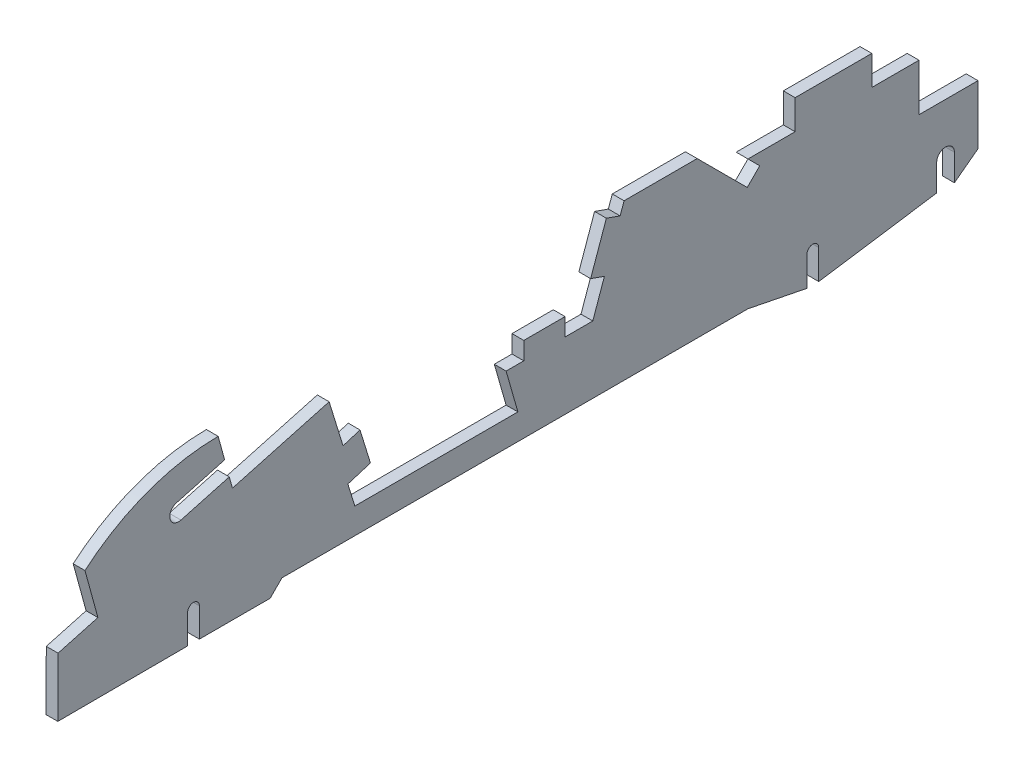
ISO-10303-21;
HEADER;
FILE_DESCRIPTION(('STEP AP214'),'2;1');
FILE_NAME('part.step','',(''),(''),'','','');
FILE_SCHEMA(('AUTOMOTIVE_DESIGN { 1 0 10303 214 1 1 1 1 }'));
ENDSEC;
DATA;
#1=APPLICATION_CONTEXT('core data for automotive mechanical design processes');
#2=APPLICATION_PROTOCOL_DEFINITION('international standard','automotive_design',2000,#1);
#3=PRODUCT_CONTEXT('',#1,'mechanical');
#4=PRODUCT('Part','Part','',(#3));
#5=PRODUCT_RELATED_PRODUCT_CATEGORY('part','',(#4));
#6=PRODUCT_DEFINITION_FORMATION('','',#4);
#7=PRODUCT_DEFINITION_CONTEXT('part definition',#1,'design');
#8=PRODUCT_DEFINITION('design','',#6,#7);
#9=PRODUCT_DEFINITION_SHAPE('','',#8);
#10=(LENGTH_UNIT() NAMED_UNIT(*) SI_UNIT(.MILLI.,.METRE.));
#11=(NAMED_UNIT(*) PLANE_ANGLE_UNIT() SI_UNIT($,.RADIAN.));
#12=(NAMED_UNIT(*) SI_UNIT($,.STERADIAN.) SOLID_ANGLE_UNIT());
#13=UNCERTAINTY_MEASURE_WITH_UNIT(LENGTH_MEASURE(1.E-05),#10,'distance_accuracy_value','');
#14=(GEOMETRIC_REPRESENTATION_CONTEXT(3) GLOBAL_UNCERTAINTY_ASSIGNED_CONTEXT((#13)) GLOBAL_UNIT_ASSIGNED_CONTEXT((#10,
#11,#12)) REPRESENTATION_CONTEXT('',''));
#15=CARTESIAN_POINT('',(0.,0.,0.));
#16=DIRECTION('',(0.,0.,1.));
#17=DIRECTION('',(1.,0.,0.));
#18=AXIS2_PLACEMENT_3D('',#15,#16,#17);
#19=CARTESIAN_POINT('',(2.,0.,7.));
#20=DIRECTION('',(0.,0.,1.));
#21=DIRECTION('',(0.,-1.,0.));
#22=AXIS2_PLACEMENT_3D('',#19,#20,#21);
#23=PLANE('',#22);
#24=DIRECTION('',(0.,1.,0.));
#25=VECTOR('',#24,1.);
#26=CARTESIAN_POINT('',(0.,0.,7.));
#27=LINE('',#26,#25);
#28=CARTESIAN_POINT('',(0.,-13.,7.));
#29=VERTEX_POINT('',#28);
#30=CARTESIAN_POINT('',(0.,-8.5,7.));
#31=VERTEX_POINT('',#30);
#32=EDGE_CURVE('E413',#29,#31,#27,.T.);
#33=ORIENTED_EDGE('',*,*,#32,.T.);
#34=DIRECTION('',(-1.,0.,0.));
#35=VECTOR('',#34,1.);
#36=CARTESIAN_POINT('',(2.,-8.5,7.));
#37=LINE('',#36,#35);
#38=CARTESIAN_POINT('',(2.,-8.5,7.));
#39=VERTEX_POINT('',#38);
#40=EDGE_CURVE('E11',#39,#31,#37,.T.);
#41=ORIENTED_EDGE('',*,*,#40,.F.);
#42=DIRECTION('',(0.,1.,0.));
#43=VECTOR('',#42,1.);
#44=CARTESIAN_POINT('',(2.,0.,7.));
#45=LINE('',#44,#43);
#46=CARTESIAN_POINT('',(2.,-13.,7.));
#47=VERTEX_POINT('',#46);
#48=EDGE_CURVE('E523',#47,#39,#45,.T.);
#49=ORIENTED_EDGE('',*,*,#48,.F.);
#50=DIRECTION('',(-1.,0.,0.));
#51=VECTOR('',#50,1.);
#52=CARTESIAN_POINT('',(2.,-13.,7.));
#53=LINE('',#52,#51);
#54=EDGE_CURVE('E409',#47,#29,#53,.T.);
#55=ORIENTED_EDGE('',*,*,#54,.T.);
#56=EDGE_LOOP('',(#33,#41,#49,#55));
#57=FACE_BOUND('',#56,.T.);
#58=ADVANCED_FACE('F35',(#57),#23,.F.);
#59=CARTESIAN_POINT('',(2.,-8.5,5.5));
#60=DIRECTION('',(-1.,0.,0.));
#61=DIRECTION('',(0.,0.,1.));
#62=AXIS2_PLACEMENT_3D('',#59,#60,#61);
#63=CYLINDRICAL_SURFACE('',#62,1.5);
#64=CARTESIAN_POINT('',(0.,-8.5,5.5));
#65=DIRECTION('',(1.,0.,0.));
#66=DIRECTION('',(0.,0.,-1.));
#67=AXIS2_PLACEMENT_3D('',#64,#65,#66);
#68=CIRCLE('',#67,1.5);
#69=CARTESIAN_POINT('',(0.,-8.5,4.));
#70=VERTEX_POINT('',#69);
#71=EDGE_CURVE('E416',#31,#70,#68,.F.);
#72=ORIENTED_EDGE('',*,*,#71,.T.);
#73=DIRECTION('',(-1.,0.,0.));
#74=VECTOR('',#73,1.);
#75=CARTESIAN_POINT('',(2.,-8.5,4.));
#76=LINE('',#75,#74);
#77=CARTESIAN_POINT('',(2.,-8.5,4.));
#78=VERTEX_POINT('',#77);
#79=EDGE_CURVE('E43',#78,#70,#76,.T.);
#80=ORIENTED_EDGE('',*,*,#79,.F.);
#81=CARTESIAN_POINT('',(2.,-8.5,5.5));
#82=DIRECTION('',(1.,0.,0.));
#83=DIRECTION('',(0.,0.,-1.));
#84=AXIS2_PLACEMENT_3D('',#81,#82,#83);
#85=CIRCLE('',#84,1.5);
#86=EDGE_CURVE('E235',#39,#78,#85,.F.);
#87=ORIENTED_EDGE('',*,*,#86,.F.);
#88=ORIENTED_EDGE('',*,*,#40,.T.);
#89=EDGE_LOOP('',(#72,#80,#87,#88));
#90=FACE_BOUND('',#89,.T.);
#91=ADVANCED_FACE('F815',(#90),#63,.F.);
#92=CARTESIAN_POINT('',(2.,0.,4.));
#93=DIRECTION('',(0.,0.,-1.));
#94=DIRECTION('',(-1.,0.,0.));
#95=AXIS2_PLACEMENT_3D('',#92,#93,#94);
#96=PLANE('',#95);
#97=DIRECTION('',(0.,-1.,0.));
#98=VECTOR('',#97,1.);
#99=CARTESIAN_POINT('',(0.,0.,4.));
#100=LINE('',#99,#98);
#101=CARTESIAN_POINT('',(0.,-13.,4.));
#102=VERTEX_POINT('',#101);
#103=EDGE_CURVE('E418',#70,#102,#100,.T.);
#104=ORIENTED_EDGE('',*,*,#103,.T.);
#105=DIRECTION('',(-1.,0.,0.));
#106=VECTOR('',#105,1.);
#107=CARTESIAN_POINT('',(2.,-13.,4.));
#108=LINE('',#107,#106);
#109=CARTESIAN_POINT('',(2.,-13.,4.));
#110=VERTEX_POINT('',#109);
#111=EDGE_CURVE('E669',#110,#102,#108,.T.);
#112=ORIENTED_EDGE('',*,*,#111,.F.);
#113=DIRECTION('',(0.,-1.,0.));
#114=VECTOR('',#113,1.);
#115=CARTESIAN_POINT('',(2.,0.,4.));
#116=LINE('',#115,#114);
#117=EDGE_CURVE('E677',#78,#110,#116,.T.);
#118=ORIENTED_EDGE('',*,*,#117,.F.);
#119=ORIENTED_EDGE('',*,*,#79,.T.);
#120=EDGE_LOOP('',(#104,#112,#118,#119));
#121=FACE_BOUND('',#120,.T.);
#122=ADVANCED_FACE('F675',(#121),#96,.F.);
#123=CARTESIAN_POINT('',(2.,-6.4,-4.8));
#124=DIRECTION('',(0.,0.8,0.6));
#125=DIRECTION('',(0.,-0.6,0.8));
#126=AXIS2_PLACEMENT_3D('',#123,#124,#125);
#127=PLANE('',#126);
#128=DIRECTION('',(0.,0.6,-0.8));
#129=VECTOR('',#128,1.);
#130=CARTESIAN_POINT('',(0.,-6.4,-4.8));
#131=LINE('',#130,#129);
#132=CARTESIAN_POINT('',(0.,-10.,0.));
#133=VERTEX_POINT('',#132);
#134=EDGE_CURVE('E420',#102,#133,#131,.T.);
#135=ORIENTED_EDGE('',*,*,#134,.T.);
#136=DIRECTION('',(-1.,0.,0.));
#137=VECTOR('',#136,1.);
#138=CARTESIAN_POINT('',(2.,-10.,0.));
#139=LINE('',#138,#137);
#140=CARTESIAN_POINT('',(2.,-10.,0.));
#141=VERTEX_POINT('',#140);
#142=EDGE_CURVE('E666',#141,#133,#139,.T.);
#143=ORIENTED_EDGE('',*,*,#142,.F.);
#144=DIRECTION('',(0.,0.6,-0.8));
#145=VECTOR('',#144,1.);
#146=CARTESIAN_POINT('',(2.,-6.4,-4.8));
#147=LINE('',#146,#145);
#148=EDGE_CURVE('E695',#110,#141,#147,.T.);
#149=ORIENTED_EDGE('',*,*,#148,.F.);
#150=ORIENTED_EDGE('',*,*,#111,.T.);
#151=EDGE_LOOP('',(#135,#143,#149,#150));
#152=FACE_BOUND('',#151,.T.);
#153=ADVANCED_FACE('F686',(#152),#127,.F.);
#154=CARTESIAN_POINT('',(2.,0.,0.));
#155=DIRECTION('',(0.,0.,1.));
#156=DIRECTION('',(1.,0.,0.));
#157=AXIS2_PLACEMENT_3D('',#154,#155,#156);
#158=PLANE('',#157);
#159=DIRECTION('',(0.,1.,0.));
#160=VECTOR('',#159,1.);
#161=CARTESIAN_POINT('',(0.,0.,0.));
#162=LINE('',#161,#160);
#163=CARTESIAN_POINT('',(0.,0.,0.));
#164=VERTEX_POINT('',#163);
#165=EDGE_CURVE('E422',#133,#164,#162,.T.);
#166=ORIENTED_EDGE('',*,*,#165,.T.);
#167=DIRECTION('',(-1.,0.,0.));
#168=VECTOR('',#167,1.);
#169=CARTESIAN_POINT('',(2.,0.,0.));
#170=LINE('',#169,#168);
#171=CARTESIAN_POINT('',(2.,0.,0.));
#172=VERTEX_POINT('',#171);
#173=EDGE_CURVE('E663',#172,#164,#170,.T.);
#174=ORIENTED_EDGE('',*,*,#173,.F.);
#175=DIRECTION('',(0.,1.,0.));
#176=VECTOR('',#175,1.);
#177=CARTESIAN_POINT('',(2.,0.,0.));
#178=LINE('',#177,#176);
#179=EDGE_CURVE('E692',#141,#172,#178,.T.);
#180=ORIENTED_EDGE('',*,*,#179,.F.);
#181=ORIENTED_EDGE('',*,*,#142,.T.);
#182=EDGE_LOOP('',(#166,#174,#180,#181));
#183=FACE_BOUND('',#182,.T.);
#184=ADVANCED_FACE('F690',(#183),#158,.F.);
#185=CARTESIAN_POINT('',(2.,0.,0.));
#186=DIRECTION('',(0.,-1.,0.));
#187=DIRECTION('',(0.,0.,-1.));
#188=AXIS2_PLACEMENT_3D('',#185,#186,#187);
#189=PLANE('',#188);
#190=DIRECTION('',(0.,0.,1.));
#191=VECTOR('',#190,1.);
#192=CARTESIAN_POINT('',(0.,0.,0.));
#193=LINE('',#192,#191);
#194=CARTESIAN_POINT('',(0.,0.,10.));
#195=VERTEX_POINT('',#194);
#196=EDGE_CURVE('E424',#164,#195,#193,.T.);
#197=ORIENTED_EDGE('',*,*,#196,.T.);
#198=DIRECTION('',(-1.,0.,0.));
#199=VECTOR('',#198,1.);
#200=CARTESIAN_POINT('',(2.,0.,10.));
#201=LINE('',#200,#199);
#202=CARTESIAN_POINT('',(2.,0.,10.));
#203=VERTEX_POINT('',#202);
#204=EDGE_CURVE('E660',#203,#195,#201,.T.);
#205=ORIENTED_EDGE('',*,*,#204,.F.);
#206=DIRECTION('',(0.,0.,1.));
#207=VECTOR('',#206,1.);
#208=CARTESIAN_POINT('',(2.,0.,0.));
#209=LINE('',#208,#207);
#210=EDGE_CURVE('E694',#172,#203,#209,.T.);
#211=ORIENTED_EDGE('',*,*,#210,.F.);
#212=ORIENTED_EDGE('',*,*,#173,.T.);
#213=EDGE_LOOP('',(#197,#205,#211,#212));
#214=FACE_BOUND('',#213,.T.);
#215=ADVANCED_FACE('F828',(#214),#189,.F.);
#216=CARTESIAN_POINT('',(2.,0.,10.));
#217=DIRECTION('',(0.,0.,1.));
#218=DIRECTION('',(1.,0.,0.));
#219=AXIS2_PLACEMENT_3D('',#216,#217,#218);
#220=PLANE('',#219);
#221=DIRECTION('',(0.,1.,0.));
#222=VECTOR('',#221,1.);
#223=CARTESIAN_POINT('',(0.,0.,10.));
#224=LINE('',#223,#222);
#225=CARTESIAN_POINT('',(0.,8.,10.));
#226=VERTEX_POINT('',#225);
#227=EDGE_CURVE('E426',#195,#226,#224,.T.);
#228=ORIENTED_EDGE('',*,*,#227,.T.);
#229=DIRECTION('',(-1.,0.,0.));
#230=VECTOR('',#229,1.);
#231=CARTESIAN_POINT('',(2.,8.,10.));
#232=LINE('',#231,#230);
#233=CARTESIAN_POINT('',(2.,8.,10.));
#234=VERTEX_POINT('',#233);
#235=EDGE_CURVE('E657',#234,#226,#232,.T.);
#236=ORIENTED_EDGE('',*,*,#235,.F.);
#237=DIRECTION('',(0.,1.,0.));
#238=VECTOR('',#237,1.);
#239=CARTESIAN_POINT('',(2.,0.,10.));
#240=LINE('',#239,#238);
#241=EDGE_CURVE('E697',#203,#234,#240,.T.);
#242=ORIENTED_EDGE('',*,*,#241,.F.);
#243=ORIENTED_EDGE('',*,*,#204,.T.);
#244=EDGE_LOOP('',(#228,#236,#242,#243));
#245=FACE_BOUND('',#244,.T.);
#246=ADVANCED_FACE('F831',(#245),#220,.F.);
#247=CARTESIAN_POINT('',(2.,8.,0.));
#248=DIRECTION('',(0.,-1.,0.));
#249=DIRECTION('',(0.,0.,-1.));
#250=AXIS2_PLACEMENT_3D('',#247,#248,#249);
#251=PLANE('',#250);
#252=DIRECTION('',(0.,0.,1.));
#253=VECTOR('',#252,1.);
#254=CARTESIAN_POINT('',(0.,8.,0.));
#255=LINE('',#254,#253);
#256=CARTESIAN_POINT('',(0.,8.,18.));
#257=VERTEX_POINT('',#256);
#258=EDGE_CURVE('E428',#226,#257,#255,.T.);
#259=ORIENTED_EDGE('',*,*,#258,.T.);
#260=DIRECTION('',(-1.,0.,0.));
#261=VECTOR('',#260,1.);
#262=CARTESIAN_POINT('',(2.,8.,18.));
#263=LINE('',#262,#261);
#264=CARTESIAN_POINT('',(2.,8.,18.));
#265=VERTEX_POINT('',#264);
#266=EDGE_CURVE('E654',#265,#257,#263,.T.);
#267=ORIENTED_EDGE('',*,*,#266,.F.);
#268=DIRECTION('',(0.,0.,1.));
#269=VECTOR('',#268,1.);
#270=CARTESIAN_POINT('',(2.,8.,0.));
#271=LINE('',#270,#269);
#272=EDGE_CURVE('E703',#234,#265,#271,.T.);
#273=ORIENTED_EDGE('',*,*,#272,.F.);
#274=ORIENTED_EDGE('',*,*,#235,.T.);
#275=EDGE_LOOP('',(#259,#267,#273,#274));
#276=FACE_BOUND('',#275,.T.);
#277=ADVANCED_FACE('F835',(#276),#251,.F.);
#278=CARTESIAN_POINT('',(2.,0.,18.));
#279=DIRECTION('',(0.,0.,1.));
#280=DIRECTION('',(1.,0.,0.));
#281=AXIS2_PLACEMENT_3D('',#278,#279,#280);
#282=PLANE('',#281);
#283=DIRECTION('',(0.,1.,0.));
#284=VECTOR('',#283,1.);
#285=CARTESIAN_POINT('',(0.,0.,18.));
#286=LINE('',#285,#284);
#287=CARTESIAN_POINT('',(0.,13.,18.));
#288=VERTEX_POINT('',#287);
#289=EDGE_CURVE('E430',#257,#288,#286,.T.);
#290=ORIENTED_EDGE('',*,*,#289,.T.);
#291=DIRECTION('',(-1.,0.,0.));
#292=VECTOR('',#291,1.);
#293=CARTESIAN_POINT('',(2.,13.,18.));
#294=LINE('',#293,#292);
#295=CARTESIAN_POINT('',(2.,13.,18.));
#296=VERTEX_POINT('',#295);
#297=EDGE_CURVE('E651',#296,#288,#294,.T.);
#298=ORIENTED_EDGE('',*,*,#297,.F.);
#299=DIRECTION('',(0.,1.,0.));
#300=VECTOR('',#299,1.);
#301=CARTESIAN_POINT('',(2.,0.,18.));
#302=LINE('',#301,#300);
#303=EDGE_CURVE('E705',#265,#296,#302,.T.);
#304=ORIENTED_EDGE('',*,*,#303,.F.);
#305=ORIENTED_EDGE('',*,*,#266,.T.);
#306=EDGE_LOOP('',(#290,#298,#304,#305));
#307=FACE_BOUND('',#306,.T.);
#308=ADVANCED_FACE('F839',(#307),#282,.F.);
#309=CARTESIAN_POINT('',(2.,13.,0.));
#310=DIRECTION('',(0.,-1.,0.));
#311=DIRECTION('',(0.,0.,-1.));
#312=AXIS2_PLACEMENT_3D('',#309,#310,#311);
#313=PLANE('',#312);
#314=DIRECTION('',(0.,0.,1.));
#315=VECTOR('',#314,1.);
#316=CARTESIAN_POINT('',(0.,13.,0.));
#317=LINE('',#316,#315);
#318=CARTESIAN_POINT('',(0.,13.,31.));
#319=VERTEX_POINT('',#318);
#320=EDGE_CURVE('E432',#288,#319,#317,.T.);
#321=ORIENTED_EDGE('',*,*,#320,.T.);
#322=DIRECTION('',(-1.,0.,0.));
#323=VECTOR('',#322,1.);
#324=CARTESIAN_POINT('',(2.,13.,31.));
#325=LINE('',#324,#323);
#326=CARTESIAN_POINT('',(2.,13.,31.));
#327=VERTEX_POINT('',#326);
#328=EDGE_CURVE('E648',#327,#319,#325,.T.);
#329=ORIENTED_EDGE('',*,*,#328,.F.);
#330=DIRECTION('',(0.,0.,1.));
#331=VECTOR('',#330,1.);
#332=CARTESIAN_POINT('',(2.,13.,0.));
#333=LINE('',#332,#331);
#334=EDGE_CURVE('E707',#296,#327,#333,.T.);
#335=ORIENTED_EDGE('',*,*,#334,.F.);
#336=ORIENTED_EDGE('',*,*,#297,.T.);
#337=EDGE_LOOP('',(#321,#329,#335,#336));
#338=FACE_BOUND('',#337,.T.);
#339=ADVANCED_FACE('F843',(#338),#313,.F.);
#340=CARTESIAN_POINT('',(2.,0.,31.));
#341=DIRECTION('',(0.,0.,-1.));
#342=DIRECTION('',(-1.,0.,0.));
#343=AXIS2_PLACEMENT_3D('',#340,#341,#342);
#344=PLANE('',#343);
#345=DIRECTION('',(0.,-1.,0.));
#346=VECTOR('',#345,1.);
#347=CARTESIAN_POINT('',(0.,0.,31.));
#348=LINE('',#347,#346);
#349=CARTESIAN_POINT('',(0.,8.,31.));
#350=VERTEX_POINT('',#349);
#351=EDGE_CURVE('E434',#319,#350,#348,.T.);
#352=ORIENTED_EDGE('',*,*,#351,.T.);
#353=DIRECTION('',(-1.,0.,0.));
#354=VECTOR('',#353,1.);
#355=CARTESIAN_POINT('',(2.,8.,31.));
#356=LINE('',#355,#354);
#357=CARTESIAN_POINT('',(2.,8.,31.));
#358=VERTEX_POINT('',#357);
#359=EDGE_CURVE('E645',#358,#350,#356,.T.);
#360=ORIENTED_EDGE('',*,*,#359,.F.);
#361=DIRECTION('',(0.,-1.,0.));
#362=VECTOR('',#361,1.);
#363=CARTESIAN_POINT('',(2.,0.,31.));
#364=LINE('',#363,#362);
#365=EDGE_CURVE('E709',#327,#358,#364,.T.);
#366=ORIENTED_EDGE('',*,*,#365,.F.);
#367=ORIENTED_EDGE('',*,*,#328,.T.);
#368=EDGE_LOOP('',(#352,#360,#366,#367));
#369=FACE_BOUND('',#368,.T.);
#370=ADVANCED_FACE('F847',(#369),#344,.F.);
#371=CARTESIAN_POINT('',(2.,8.,0.));
#372=DIRECTION('',(0.,-1.,0.));
#373=DIRECTION('',(0.,0.,-1.));
#374=AXIS2_PLACEMENT_3D('',#371,#372,#373);
#375=PLANE('',#374);
#376=DIRECTION('',(0.,0.,1.));
#377=VECTOR('',#376,1.);
#378=CARTESIAN_POINT('',(0.,8.,0.));
#379=LINE('',#378,#377);
#380=CARTESIAN_POINT('',(0.,8.,39.));
#381=VERTEX_POINT('',#380);
#382=EDGE_CURVE('E436',#350,#381,#379,.T.);
#383=ORIENTED_EDGE('',*,*,#382,.T.);
#384=DIRECTION('',(-1.,0.,0.));
#385=VECTOR('',#384,1.);
#386=CARTESIAN_POINT('',(2.,8.,39.));
#387=LINE('',#386,#385);
#388=CARTESIAN_POINT('',(2.,8.,39.));
#389=VERTEX_POINT('',#388);
#390=EDGE_CURVE('E642',#389,#381,#387,.T.);
#391=ORIENTED_EDGE('',*,*,#390,.F.);
#392=DIRECTION('',(0.,0.,1.));
#393=VECTOR('',#392,1.);
#394=CARTESIAN_POINT('',(2.,8.,0.));
#395=LINE('',#394,#393);
#396=EDGE_CURVE('E711',#358,#389,#395,.T.);
#397=ORIENTED_EDGE('',*,*,#396,.F.);
#398=ORIENTED_EDGE('',*,*,#359,.T.);
#399=EDGE_LOOP('',(#383,#391,#397,#398));
#400=FACE_BOUND('',#399,.T.);
#401=ADVANCED_FACE('F851',(#400),#375,.F.);
#402=CARTESIAN_POINT('',(2.,-15.5,15.5));
#403=DIRECTION('',(0.,0.707106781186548,-0.707106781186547));
#404=DIRECTION('',(0.,0.707106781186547,0.707106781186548));
#405=AXIS2_PLACEMENT_3D('',#402,#403,#404);
#406=PLANE('',#405);
#407=DIRECTION('',(0.,-0.707106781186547,-0.707106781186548));
#408=VECTOR('',#407,1.);
#409=CARTESIAN_POINT('',(0.,-15.5,15.5));
#410=LINE('',#409,#408);
#411=CARTESIAN_POINT('',(0.,6.,37.));
#412=VERTEX_POINT('',#411);
#413=EDGE_CURVE('E438',#381,#412,#410,.T.);
#414=ORIENTED_EDGE('',*,*,#413,.T.);
#415=DIRECTION('',(-1.,0.,0.));
#416=VECTOR('',#415,1.);
#417=CARTESIAN_POINT('',(2.,6.,37.));
#418=LINE('',#417,#416);
#419=CARTESIAN_POINT('',(2.,6.,37.));
#420=VERTEX_POINT('',#419);
#421=EDGE_CURVE('E639',#420,#412,#418,.T.);
#422=ORIENTED_EDGE('',*,*,#421,.F.);
#423=DIRECTION('',(0.,-0.707106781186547,-0.707106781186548));
#424=VECTOR('',#423,1.);
#425=CARTESIAN_POINT('',(2.,-15.5,15.5));
#426=LINE('',#425,#424);
#427=EDGE_CURVE('E713',#389,#420,#426,.T.);
#428=ORIENTED_EDGE('',*,*,#427,.F.);
#429=ORIENTED_EDGE('',*,*,#390,.T.);
#430=EDGE_LOOP('',(#414,#422,#428,#429));
#431=FACE_BOUND('',#430,.T.);
#432=ADVANCED_FACE('F855',(#431),#406,.F.);
#433=CARTESIAN_POINT('',(2.,21.5,21.5));
#434=DIRECTION('',(0.,-0.707106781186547,-0.707106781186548));
#435=DIRECTION('',(0.,0.707106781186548,-0.707106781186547));
#436=AXIS2_PLACEMENT_3D('',#433,#434,#435);
#437=PLANE('',#436);
#438=DIRECTION('',(0.,-0.707106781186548,0.707106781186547));
#439=VECTOR('',#438,1.);
#440=CARTESIAN_POINT('',(0.,21.5,21.5));
#441=LINE('',#440,#439);
#442=CARTESIAN_POINT('',(0.,3.87867965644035,39.1213203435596));
#443=VERTEX_POINT('',#442);
#444=EDGE_CURVE('E440',#412,#443,#441,.T.);
#445=ORIENTED_EDGE('',*,*,#444,.T.);
#446=DIRECTION('',(-1.,0.,0.));
#447=VECTOR('',#446,1.);
#448=CARTESIAN_POINT('',(2.,3.87867965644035,39.1213203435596));
#449=LINE('',#448,#447);
#450=CARTESIAN_POINT('',(2.,3.87867965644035,39.1213203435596));
#451=VERTEX_POINT('',#450);
#452=EDGE_CURVE('E636',#451,#443,#449,.T.);
#453=ORIENTED_EDGE('',*,*,#452,.F.);
#454=DIRECTION('',(0.,-0.707106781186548,0.707106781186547));
#455=VECTOR('',#454,1.);
#456=CARTESIAN_POINT('',(2.,21.5,21.5));
#457=LINE('',#456,#455);
#458=EDGE_CURVE('E715',#420,#451,#457,.T.);
#459=ORIENTED_EDGE('',*,*,#458,.F.);
#460=ORIENTED_EDGE('',*,*,#421,.T.);
#461=EDGE_LOOP('',(#445,#453,#459,#460));
#462=FACE_BOUND('',#461,.T.);
#463=ADVANCED_FACE('F859',(#462),#437,.F.);
#464=CARTESIAN_POINT('',(2.,-17.6213203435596,17.6213203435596));
#465=DIRECTION('',(0.,-0.707106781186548,0.707106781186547));
#466=DIRECTION('',(0.,-0.707106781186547,-0.707106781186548));
#467=AXIS2_PLACEMENT_3D('',#464,#465,#466);
#468=PLANE('',#467);
#469=DIRECTION('',(0.,0.707106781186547,0.707106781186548));
#470=VECTOR('',#469,1.);
#471=CARTESIAN_POINT('',(0.,-17.6213203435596,17.6213203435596));
#472=LINE('',#471,#470);
#473=CARTESIAN_POINT('',(0.,12.3639610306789,47.6066017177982));
#474=VERTEX_POINT('',#473);
#475=EDGE_CURVE('E442',#443,#474,#472,.T.);
#476=ORIENTED_EDGE('',*,*,#475,.T.);
#477=DIRECTION('',(-1.,0.,0.));
#478=VECTOR('',#477,1.);
#479=CARTESIAN_POINT('',(2.,12.3639610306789,47.6066017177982));
#480=LINE('',#479,#478);
#481=CARTESIAN_POINT('',(2.,12.3639610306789,47.6066017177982));
#482=VERTEX_POINT('',#481);
#483=EDGE_CURVE('E633',#482,#474,#480,.T.);
#484=ORIENTED_EDGE('',*,*,#483,.F.);
#485=DIRECTION('',(0.,0.707106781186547,0.707106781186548));
#486=VECTOR('',#485,1.);
#487=CARTESIAN_POINT('',(2.,-17.6213203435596,17.6213203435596));
#488=LINE('',#487,#486);
#489=EDGE_CURVE('E717',#451,#482,#488,.T.);
#490=ORIENTED_EDGE('',*,*,#489,.F.);
#491=ORIENTED_EDGE('',*,*,#452,.T.);
#492=EDGE_LOOP('',(#476,#484,#490,#491));
#493=FACE_BOUND('',#492,.T.);
#494=ADVANCED_FACE('F863',(#493),#468,.F.);
#495=CARTESIAN_POINT('',(2.,12.3639610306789,0.));
#496=DIRECTION('',(0.,-1.,0.));
#497=DIRECTION('',(0.,0.,-1.));
#498=AXIS2_PLACEMENT_3D('',#495,#496,#497);
#499=PLANE('',#498);
#500=DIRECTION('',(0.,0.,1.));
#501=VECTOR('',#500,1.);
#502=CARTESIAN_POINT('',(0.,12.3639610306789,0.));
#503=LINE('',#502,#501);
#504=CARTESIAN_POINT('',(0.,12.3639610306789,60.));
#505=VERTEX_POINT('',#504);
#506=EDGE_CURVE('E444',#474,#505,#503,.T.);
#507=ORIENTED_EDGE('',*,*,#506,.T.);
#508=DIRECTION('',(-1.,0.,0.));
#509=VECTOR('',#508,1.);
#510=CARTESIAN_POINT('',(2.,12.3639610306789,60.));
#511=LINE('',#510,#509);
#512=CARTESIAN_POINT('',(2.,12.3639610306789,60.));
#513=VERTEX_POINT('',#512);
#514=EDGE_CURVE('E630',#513,#505,#511,.T.);
#515=ORIENTED_EDGE('',*,*,#514,.F.);
#516=DIRECTION('',(0.,0.,1.));
#517=VECTOR('',#516,1.);
#518=CARTESIAN_POINT('',(2.,12.3639610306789,0.));
#519=LINE('',#518,#517);
#520=EDGE_CURVE('E719',#482,#513,#519,.T.);
#521=ORIENTED_EDGE('',*,*,#520,.F.);
#522=ORIENTED_EDGE('',*,*,#483,.T.);
#523=EDGE_LOOP('',(#507,#515,#521,#522));
#524=FACE_BOUND('',#523,.T.);
#525=ADVANCED_FACE('F867',(#524),#499,.F.);
#526=CARTESIAN_POINT('',(2.,20.2299542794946,57.2189514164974));
#527=DIRECTION('',(0.,-0.333333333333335,-0.942809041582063));
#528=DIRECTION('',(0.,0.942809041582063,-0.333333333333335));
#529=AXIS2_PLACEMENT_3D('',#526,#527,#528);
#530=PLANE('',#529);
#531=DIRECTION('',(0.,-0.942809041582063,0.333333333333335));
#532=VECTOR('',#531,1.);
#533=CARTESIAN_POINT('',(0.,20.2299542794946,57.2189514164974));
#534=LINE('',#533,#532);
#535=CARTESIAN_POINT('',(0.,10.4783429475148,60.6666666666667));
#536=VERTEX_POINT('',#535);
#537=EDGE_CURVE('E446',#505,#536,#534,.T.);
#538=ORIENTED_EDGE('',*,*,#537,.T.);
#539=DIRECTION('',(-1.,0.,0.));
#540=VECTOR('',#539,1.);
#541=CARTESIAN_POINT('',(2.,10.4783429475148,60.6666666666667));
#542=LINE('',#541,#540);
#543=CARTESIAN_POINT('',(2.,10.4783429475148,60.6666666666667));
#544=VERTEX_POINT('',#543);
#545=EDGE_CURVE('E627',#544,#536,#542,.T.);
#546=ORIENTED_EDGE('',*,*,#545,.F.);
#547=DIRECTION('',(0.,-0.942809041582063,0.333333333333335));
#548=VECTOR('',#547,1.);
#549=CARTESIAN_POINT('',(2.,20.2299542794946,57.2189514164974));
#550=LINE('',#549,#548);
#551=EDGE_CURVE('E721',#513,#544,#550,.T.);
#552=ORIENTED_EDGE('',*,*,#551,.F.);
#553=ORIENTED_EDGE('',*,*,#514,.T.);
#554=EDGE_LOOP('',(#538,#546,#552,#553));
#555=FACE_BOUND('',#554,.T.);
#556=ADVANCED_FACE('F871',(#555),#530,.F.);
#557=CARTESIAN_POINT('',(2.,-9.75161133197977,3.44771525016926));
#558=DIRECTION('',(0.,-0.942809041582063,0.333333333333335));
#559=DIRECTION('',(0.,-0.333333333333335,-0.942809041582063));
#560=AXIS2_PLACEMENT_3D('',#557,#558,#559);
#561=PLANE('',#560);
#562=DIRECTION('',(0.,0.333333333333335,0.942809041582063));
#563=VECTOR('',#562,1.);
#564=CARTESIAN_POINT('',(0.,-9.75161133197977,3.44771525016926));
#565=LINE('',#564,#563);
#566=CARTESIAN_POINT('',(0.,11.3033008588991,63.));
#567=VERTEX_POINT('',#566);
#568=EDGE_CURVE('E448',#536,#567,#565,.T.);
#569=ORIENTED_EDGE('',*,*,#568,.T.);
#570=DIRECTION('',(-1.,0.,0.));
#571=VECTOR('',#570,1.);
#572=CARTESIAN_POINT('',(2.,11.3033008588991,63.));
#573=LINE('',#572,#571);
#574=CARTESIAN_POINT('',(2.,11.3033008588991,63.));
#575=VERTEX_POINT('',#574);
#576=EDGE_CURVE('E624',#575,#567,#573,.T.);
#577=ORIENTED_EDGE('',*,*,#576,.F.);
#578=DIRECTION('',(0.,0.333333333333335,0.942809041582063));
#579=VECTOR('',#578,1.);
#580=CARTESIAN_POINT('',(2.,-9.75161133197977,3.44771525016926));
#581=LINE('',#580,#579);
#582=EDGE_CURVE('E723',#544,#575,#581,.T.);
#583=ORIENTED_EDGE('',*,*,#582,.F.);
#584=ORIENTED_EDGE('',*,*,#545,.T.);
#585=EDGE_LOOP('',(#569,#577,#583,#584));
#586=FACE_BOUND('',#585,.T.);
#587=ADVANCED_FACE('F875',(#586),#561,.F.);
#588=CARTESIAN_POINT('',(2.,21.0549121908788,59.5522847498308));
#589=DIRECTION('',(0.,-0.333333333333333,-0.942809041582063));
#590=DIRECTION('',(0.,0.942809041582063,-0.333333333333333));
#591=AXIS2_PLACEMENT_3D('',#588,#589,#590);
#592=PLANE('',#591);
#593=DIRECTION('',(0.,-0.942809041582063,0.333333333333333));
#594=VECTOR('',#593,1.);
#595=CARTESIAN_POINT('',(0.,21.0549121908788,59.5522847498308));
#596=LINE('',#595,#594);
#597=CARTESIAN_POINT('',(0.,3.7608285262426,65.6666666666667));
#598=VERTEX_POINT('',#597);
#599=EDGE_CURVE('E450',#567,#598,#596,.T.);
#600=ORIENTED_EDGE('',*,*,#599,.T.);
#601=DIRECTION('',(-1.,0.,0.));
#602=VECTOR('',#601,1.);
#603=CARTESIAN_POINT('',(2.,3.7608285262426,65.6666666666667));
#604=LINE('',#603,#602);
#605=CARTESIAN_POINT('',(2.,3.7608285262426,65.6666666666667));
#606=VERTEX_POINT('',#605);
#607=EDGE_CURVE('E621',#606,#598,#604,.T.);
#608=ORIENTED_EDGE('',*,*,#607,.F.);
#609=DIRECTION('',(0.,-0.942809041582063,0.333333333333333));
#610=VECTOR('',#609,1.);
#611=CARTESIAN_POINT('',(2.,21.0549121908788,59.5522847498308));
#612=LINE('',#611,#610);
#613=EDGE_CURVE('E725',#575,#606,#612,.T.);
#614=ORIENTED_EDGE('',*,*,#613,.F.);
#615=ORIENTED_EDGE('',*,*,#576,.T.);
#616=EDGE_LOOP('',(#600,#608,#614,#615));
#617=FACE_BOUND('',#616,.T.);
#618=ADVANCED_FACE('F879',(#617),#592,.F.);
#619=CARTESIAN_POINT('',(2.,-17.2940836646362,6.11438191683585));
#620=DIRECTION('',(0.,0.942809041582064,-0.333333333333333));
#621=DIRECTION('',(0.,0.333333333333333,0.942809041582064));
#622=AXIS2_PLACEMENT_3D('',#619,#620,#621);
#623=PLANE('',#622);
#624=DIRECTION('',(0.,-0.333333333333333,-0.942809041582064));
#625=VECTOR('',#624,1.);
#626=CARTESIAN_POINT('',(0.,-17.2940836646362,6.11438191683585));
#627=LINE('',#626,#625);
#628=CARTESIAN_POINT('',(0.,2.93587061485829,63.3333333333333));
#629=VERTEX_POINT('',#628);
#630=EDGE_CURVE('E452',#598,#629,#627,.T.);
#631=ORIENTED_EDGE('',*,*,#630,.T.);
#632=DIRECTION('',(-1.,0.,0.));
#633=VECTOR('',#632,1.);
#634=CARTESIAN_POINT('',(2.,2.93587061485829,63.3333333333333));
#635=LINE('',#634,#633);
#636=CARTESIAN_POINT('',(2.,2.93587061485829,63.3333333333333));
#637=VERTEX_POINT('',#636);
#638=EDGE_CURVE('E618',#637,#629,#635,.T.);
#639=ORIENTED_EDGE('',*,*,#638,.F.);
#640=DIRECTION('',(0.,-0.333333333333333,-0.942809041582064));
#641=VECTOR('',#640,1.);
#642=CARTESIAN_POINT('',(2.,-17.2940836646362,6.11438191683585));
#643=LINE('',#642,#641);
#644=EDGE_CURVE('E727',#606,#637,#643,.T.);
#645=ORIENTED_EDGE('',*,*,#644,.F.);
#646=ORIENTED_EDGE('',*,*,#607,.T.);
#647=EDGE_LOOP('',(#631,#639,#645,#646));
#648=FACE_BOUND('',#647,.T.);
#649=ADVANCED_FACE('F883',(#648),#623,.F.);
#650=CARTESIAN_POINT('',(2.,20.2299542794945,57.2189514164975));
#651=DIRECTION('',(0.,-0.333333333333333,-0.942809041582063));
#652=DIRECTION('',(0.,0.942809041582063,-0.333333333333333));
#653=AXIS2_PLACEMENT_3D('',#650,#651,#652);
#654=PLANE('',#653);
#655=DIRECTION('',(0.,-0.942809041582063,0.333333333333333));
#656=VECTOR('',#655,1.);
#657=CARTESIAN_POINT('',(0.,20.2299542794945,57.2189514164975));
#658=LINE('',#657,#656);
#659=CARTESIAN_POINT('',(0.,-2.63603896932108,65.3033008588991));
#660=VERTEX_POINT('',#659);
#661=EDGE_CURVE('E454',#629,#660,#658,.T.);
#662=ORIENTED_EDGE('',*,*,#661,.T.);
#663=DIRECTION('',(-1.,0.,0.));
#664=VECTOR('',#663,1.);
#665=CARTESIAN_POINT('',(2.,-2.63603896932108,65.3033008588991));
#666=LINE('',#665,#664);
#667=CARTESIAN_POINT('',(2.,-2.63603896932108,65.3033008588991));
#668=VERTEX_POINT('',#667);
#669=EDGE_CURVE('E615',#668,#660,#666,.T.);
#670=ORIENTED_EDGE('',*,*,#669,.F.);
#671=DIRECTION('',(0.,-0.942809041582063,0.333333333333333));
#672=VECTOR('',#671,1.);
#673=CARTESIAN_POINT('',(2.,20.2299542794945,57.2189514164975));
#674=LINE('',#673,#672);
#675=EDGE_CURVE('E729',#637,#668,#674,.T.);
#676=ORIENTED_EDGE('',*,*,#675,.F.);
#677=ORIENTED_EDGE('',*,*,#638,.T.);
#678=EDGE_LOOP('',(#662,#670,#676,#677));
#679=FACE_BOUND('',#678,.T.);
#680=ADVANCED_FACE('F887',(#679),#654,.F.);
#681=CARTESIAN_POINT('',(2.,-2.63603896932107,0.));
#682=DIRECTION('',(0.,-1.,0.));
#683=DIRECTION('',(0.,0.,-1.));
#684=AXIS2_PLACEMENT_3D('',#681,#682,#683);
#685=PLANE('',#684);
#686=DIRECTION('',(0.,0.,1.));
#687=VECTOR('',#686,1.);
#688=CARTESIAN_POINT('',(0.,-2.63603896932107,0.));
#689=LINE('',#688,#687);
#690=CARTESIAN_POINT('',(0.,-2.63603896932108,70.));
#691=VERTEX_POINT('',#690);
#692=EDGE_CURVE('E456',#660,#691,#689,.T.);
#693=ORIENTED_EDGE('',*,*,#692,.T.);
#694=DIRECTION('',(-1.,0.,0.));
#695=VECTOR('',#694,1.);
#696=CARTESIAN_POINT('',(2.,-2.63603896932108,70.));
#697=LINE('',#696,#695);
#698=CARTESIAN_POINT('',(2.,-2.63603896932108,70.));
#699=VERTEX_POINT('',#698);
#700=EDGE_CURVE('E612',#699,#691,#697,.T.);
#701=ORIENTED_EDGE('',*,*,#700,.F.);
#702=DIRECTION('',(0.,0.,1.));
#703=VECTOR('',#702,1.);
#704=CARTESIAN_POINT('',(2.,-2.63603896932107,0.));
#705=LINE('',#704,#703);
#706=EDGE_CURVE('E731',#668,#699,#705,.T.);
#707=ORIENTED_EDGE('',*,*,#706,.F.);
#708=ORIENTED_EDGE('',*,*,#669,.T.);
#709=EDGE_LOOP('',(#693,#701,#707,#708));
#710=FACE_BOUND('',#709,.T.);
#711=ADVANCED_FACE('F891',(#710),#685,.F.);
#712=CARTESIAN_POINT('',(2.,0.,70.));
#713=DIRECTION('',(0.,0.,1.));
#714=DIRECTION('',(1.,0.,0.));
#715=AXIS2_PLACEMENT_3D('',#712,#713,#714);
#716=PLANE('',#715);
#717=DIRECTION('',(0.,1.,0.));
#718=VECTOR('',#717,1.);
#719=CARTESIAN_POINT('',(0.,0.,70.));
#720=LINE('',#719,#718);
#721=CARTESIAN_POINT('',(0.,0.363961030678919,70.));
#722=VERTEX_POINT('',#721);
#723=EDGE_CURVE('E458',#691,#722,#720,.T.);
#724=ORIENTED_EDGE('',*,*,#723,.T.);
#725=DIRECTION('',(-1.,0.,0.));
#726=VECTOR('',#725,1.);
#727=CARTESIAN_POINT('',(2.,0.363961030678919,70.));
#728=LINE('',#727,#726);
#729=CARTESIAN_POINT('',(2.,0.363961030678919,70.));
#730=VERTEX_POINT('',#729);
#731=EDGE_CURVE('E609',#730,#722,#728,.T.);
#732=ORIENTED_EDGE('',*,*,#731,.F.);
#733=DIRECTION('',(0.,1.,0.));
#734=VECTOR('',#733,1.);
#735=CARTESIAN_POINT('',(2.,0.,70.));
#736=LINE('',#735,#734);
#737=EDGE_CURVE('E733',#699,#730,#736,.T.);
#738=ORIENTED_EDGE('',*,*,#737,.F.);
#739=ORIENTED_EDGE('',*,*,#700,.T.);
#740=EDGE_LOOP('',(#724,#732,#738,#739));
#741=FACE_BOUND('',#740,.T.);
#742=ADVANCED_FACE('F895',(#741),#716,.F.);
#743=CARTESIAN_POINT('',(2.,0.363961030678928,0.));
#744=DIRECTION('',(0.,-1.,0.));
#745=DIRECTION('',(0.,0.,-1.));
#746=AXIS2_PLACEMENT_3D('',#743,#744,#745);
#747=PLANE('',#746);
#748=DIRECTION('',(0.,0.,1.));
#749=VECTOR('',#748,1.);
#750=CARTESIAN_POINT('',(0.,0.363961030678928,0.));
#751=LINE('',#750,#749);
#752=CARTESIAN_POINT('',(0.,0.363961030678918,77.));
#753=VERTEX_POINT('',#752);
#754=EDGE_CURVE('E460',#722,#753,#751,.T.);
#755=ORIENTED_EDGE('',*,*,#754,.T.);
#756=DIRECTION('',(-1.,0.,0.));
#757=VECTOR('',#756,1.);
#758=CARTESIAN_POINT('',(2.,0.363961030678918,77.));
#759=LINE('',#758,#757);
#760=CARTESIAN_POINT('',(2.,0.363961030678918,77.));
#761=VERTEX_POINT('',#760);
#762=EDGE_CURVE('E606',#761,#753,#759,.T.);
#763=ORIENTED_EDGE('',*,*,#762,.F.);
#764=DIRECTION('',(0.,0.,1.));
#765=VECTOR('',#764,1.);
#766=CARTESIAN_POINT('',(2.,0.363961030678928,0.));
#767=LINE('',#766,#765);
#768=EDGE_CURVE('E735',#730,#761,#767,.T.);
#769=ORIENTED_EDGE('',*,*,#768,.F.);
#770=ORIENTED_EDGE('',*,*,#731,.T.);
#771=EDGE_LOOP('',(#755,#763,#769,#770));
#772=FACE_BOUND('',#771,.T.);
#773=ADVANCED_FACE('F899',(#772),#747,.F.);
#774=CARTESIAN_POINT('',(2.,0.,77.));
#775=DIRECTION('',(0.,0.,-1.));
#776=DIRECTION('',(-1.,0.,0.));
#777=AXIS2_PLACEMENT_3D('',#774,#775,#776);
#778=PLANE('',#777);
#779=DIRECTION('',(0.,-1.,0.));
#780=VECTOR('',#779,1.);
#781=CARTESIAN_POINT('',(0.,0.,77.));
#782=LINE('',#781,#780);
#783=CARTESIAN_POINT('',(0.,-2.63603896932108,77.));
#784=VERTEX_POINT('',#783);
#785=EDGE_CURVE('E462',#753,#784,#782,.T.);
#786=ORIENTED_EDGE('',*,*,#785,.T.);
#787=DIRECTION('',(-1.,0.,0.));
#788=VECTOR('',#787,1.);
#789=CARTESIAN_POINT('',(2.,-2.63603896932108,77.));
#790=LINE('',#789,#788);
#791=CARTESIAN_POINT('',(2.,-2.63603896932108,77.));
#792=VERTEX_POINT('',#791);
#793=EDGE_CURVE('E603',#792,#784,#790,.T.);
#794=ORIENTED_EDGE('',*,*,#793,.F.);
#795=DIRECTION('',(0.,-1.,0.));
#796=VECTOR('',#795,1.);
#797=CARTESIAN_POINT('',(2.,0.,77.));
#798=LINE('',#797,#796);
#799=EDGE_CURVE('E737',#761,#792,#798,.T.);
#800=ORIENTED_EDGE('',*,*,#799,.F.);
#801=ORIENTED_EDGE('',*,*,#762,.T.);
#802=EDGE_LOOP('',(#786,#794,#800,#801));
#803=FACE_BOUND('',#802,.T.);
#804=ADVANCED_FACE('F903',(#803),#778,.F.);
#805=CARTESIAN_POINT('',(2.,-2.63603896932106,0.));
#806=DIRECTION('',(0.,-1.,0.));
#807=DIRECTION('',(0.,0.,-1.));
#808=AXIS2_PLACEMENT_3D('',#805,#806,#807);
#809=PLANE('',#808);
#810=DIRECTION('',(0.,0.,1.));
#811=VECTOR('',#810,1.);
#812=CARTESIAN_POINT('',(0.,-2.63603896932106,0.));
#813=LINE('',#812,#811);
#814=CARTESIAN_POINT('',(0.,-2.63603896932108,80.));
#815=VERTEX_POINT('',#814);
#816=EDGE_CURVE('E464',#784,#815,#813,.T.);
#817=ORIENTED_EDGE('',*,*,#816,.T.);
#818=DIRECTION('',(-1.,0.,0.));
#819=VECTOR('',#818,1.);
#820=CARTESIAN_POINT('',(2.,-2.63603896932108,80.));
#821=LINE('',#820,#819);
#822=CARTESIAN_POINT('',(2.,-2.63603896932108,80.));
#823=VERTEX_POINT('',#822);
#824=EDGE_CURVE('E600',#823,#815,#821,.T.);
#825=ORIENTED_EDGE('',*,*,#824,.F.);
#826=DIRECTION('',(0.,0.,1.));
#827=VECTOR('',#826,1.);
#828=CARTESIAN_POINT('',(2.,-2.63603896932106,0.));
#829=LINE('',#828,#827);
#830=EDGE_CURVE('E739',#792,#823,#829,.T.);
#831=ORIENTED_EDGE('',*,*,#830,.F.);
#832=ORIENTED_EDGE('',*,*,#793,.T.);
#833=EDGE_LOOP('',(#817,#825,#831,#832));
#834=FACE_BOUND('',#833,.T.);
#835=ADVANCED_FACE('F907',(#834),#809,.F.);
#836=CARTESIAN_POINT('',(2.,-21.3310218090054,74.6585763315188));
#837=DIRECTION('',(0.,0.274721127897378,-0.961523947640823));
#838=DIRECTION('',(0.,0.961523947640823,0.274721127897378));
#839=AXIS2_PLACEMENT_3D('',#836,#837,#838);
#840=PLANE('',#839);
#841=DIRECTION('',(0.,-0.961523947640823,-0.274721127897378));
#842=VECTOR('',#841,1.);
#843=CARTESIAN_POINT('',(0.,-21.3310218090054,74.6585763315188));
#844=LINE('',#843,#842);
#845=CARTESIAN_POINT('',(0.,-9.63603896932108,78.));
#846=VERTEX_POINT('',#845);
#847=EDGE_CURVE('E466',#815,#846,#844,.T.);
#848=ORIENTED_EDGE('',*,*,#847,.T.);
#849=DIRECTION('',(-1.,0.,0.));
#850=VECTOR('',#849,1.);
#851=CARTESIAN_POINT('',(2.,-9.63603896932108,78.));
#852=LINE('',#851,#850);
#853=CARTESIAN_POINT('',(2.,-9.63603896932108,78.));
#854=VERTEX_POINT('',#853);
#855=EDGE_CURVE('E597',#854,#846,#852,.T.);
#856=ORIENTED_EDGE('',*,*,#855,.F.);
#857=DIRECTION('',(0.,-0.961523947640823,-0.274721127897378));
#858=VECTOR('',#857,1.);
#859=CARTESIAN_POINT('',(2.,-21.3310218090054,74.6585763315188));
#860=LINE('',#859,#858);
#861=EDGE_CURVE('E741',#823,#854,#860,.T.);
#862=ORIENTED_EDGE('',*,*,#861,.F.);
#863=ORIENTED_EDGE('',*,*,#824,.T.);
#864=EDGE_LOOP('',(#848,#856,#862,#863));
#865=FACE_BOUND('',#864,.T.);
#866=ADVANCED_FACE('F911',(#865),#840,.F.);
#867=CARTESIAN_POINT('',(2.,-9.63603896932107,0.));
#868=DIRECTION('',(0.,-1.,0.));
#869=DIRECTION('',(0.,0.,-1.));
#870=AXIS2_PLACEMENT_3D('',#867,#868,#869);
#871=PLANE('',#870);
#872=DIRECTION('',(0.,0.,1.));
#873=VECTOR('',#872,1.);
#874=CARTESIAN_POINT('',(0.,-9.63603896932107,0.));
#875=LINE('',#874,#873);
#876=CARTESIAN_POINT('',(0.,-9.63603896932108,105.645751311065));
#877=VERTEX_POINT('',#876);
#878=EDGE_CURVE('E468',#846,#877,#875,.T.);
#879=ORIENTED_EDGE('',*,*,#878,.T.);
#880=DIRECTION('',(-1.,0.,0.));
#881=VECTOR('',#880,1.);
#882=CARTESIAN_POINT('',(2.,-9.63603896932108,105.645751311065));
#883=LINE('',#882,#881);
#884=CARTESIAN_POINT('',(2.,-9.63603896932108,105.645751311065));
#885=VERTEX_POINT('',#884);
#886=EDGE_CURVE('E594',#885,#877,#883,.T.);
#887=ORIENTED_EDGE('',*,*,#886,.F.);
#888=DIRECTION('',(0.,0.,1.));
#889=VECTOR('',#888,1.);
#890=CARTESIAN_POINT('',(2.,-9.63603896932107,0.));
#891=LINE('',#890,#889);
#892=EDGE_CURVE('E743',#854,#885,#891,.T.);
#893=ORIENTED_EDGE('',*,*,#892,.F.);
#894=ORIENTED_EDGE('',*,*,#855,.T.);
#895=EDGE_LOOP('',(#879,#887,#893,#894));
#896=FACE_BOUND('',#895,.T.);
#897=ADVANCED_FACE('F915',(#896),#871,.F.);
#898=CARTESIAN_POINT('',(2.,-30.5473616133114,99.2068217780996));
#899=DIRECTION('',(0.,-0.294281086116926,0.955718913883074));
#900=DIRECTION('',(0.,-0.955718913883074,-0.294281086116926));
#901=AXIS2_PLACEMENT_3D('',#898,#899,#900);
#902=PLANE('',#901);
#903=DIRECTION('',(0.,0.955718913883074,0.294281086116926));
#904=VECTOR('',#903,1.);
#905=CARTESIAN_POINT('',(0.,-30.5473616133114,99.2068217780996));
#906=LINE('',#905,#904);
#907=CARTESIAN_POINT('',(0.,-5.81316331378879,106.822875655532));
#908=VERTEX_POINT('',#907);
#909=EDGE_CURVE('E470',#877,#908,#906,.T.);
#910=ORIENTED_EDGE('',*,*,#909,.T.);
#911=DIRECTION('',(-1.,0.,0.));
#912=VECTOR('',#911,1.);
#913=CARTESIAN_POINT('',(2.,-5.81316331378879,106.822875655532));
#914=LINE('',#913,#912);
#915=CARTESIAN_POINT('',(2.,-5.81316331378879,106.822875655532));
#916=VERTEX_POINT('',#915);
#917=EDGE_CURVE('E591',#916,#908,#914,.T.);
#918=ORIENTED_EDGE('',*,*,#917,.F.);
#919=DIRECTION('',(0.,0.955718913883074,0.294281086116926));
#920=VECTOR('',#919,1.);
#921=CARTESIAN_POINT('',(2.,-30.5473616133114,99.2068217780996));
#922=LINE('',#921,#920);
#923=EDGE_CURVE('E745',#885,#916,#922,.T.);
#924=ORIENTED_EDGE('',*,*,#923,.F.);
#925=ORIENTED_EDGE('',*,*,#886,.T.);
#926=EDGE_LOOP('',(#910,#918,#924,#925));
#927=FACE_BOUND('',#926,.T.);
#928=ADVANCED_FACE('F919',(#927),#902,.F.);
#929=CARTESIAN_POINT('',(2.,24.7341982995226,7.61605387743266));
#930=DIRECTION('',(0.,0.955718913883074,0.294281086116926));
#931=DIRECTION('',(0.,-0.294281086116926,0.955718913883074));
#932=AXIS2_PLACEMENT_3D('',#929,#930,#931);
#933=PLANE('',#932);
#934=DIRECTION('',(0.,0.294281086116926,-0.955718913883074));
#935=VECTOR('',#934,1.);
#936=CARTESIAN_POINT('',(0.,24.7341982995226,7.61605387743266));
#937=LINE('',#936,#935);
#938=CARTESIAN_POINT('',(0.,-4.63603896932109,103.));
#939=VERTEX_POINT('',#938);
#940=EDGE_CURVE('E472',#908,#939,#937,.T.);
#941=ORIENTED_EDGE('',*,*,#940,.T.);
#942=DIRECTION('',(-1.,0.,0.));
#943=VECTOR('',#942,1.);
#944=CARTESIAN_POINT('',(2.,-4.63603896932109,103.));
#945=LINE('',#944,#943);
#946=CARTESIAN_POINT('',(2.,-4.63603896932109,103.));
#947=VERTEX_POINT('',#946);
#948=EDGE_CURVE('E588',#947,#939,#945,.T.);
#949=ORIENTED_EDGE('',*,*,#948,.F.);
#950=DIRECTION('',(0.,0.294281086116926,-0.955718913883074));
#951=VECTOR('',#950,1.);
#952=CARTESIAN_POINT('',(2.,24.7341982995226,7.61605387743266));
#953=LINE('',#952,#951);
#954=EDGE_CURVE('E747',#916,#947,#953,.T.);
#955=ORIENTED_EDGE('',*,*,#954,.F.);
#956=ORIENTED_EDGE('',*,*,#917,.T.);
#957=EDGE_LOOP('',(#941,#949,#955,#956));
#958=FACE_BOUND('',#957,.T.);
#959=ADVANCED_FACE('F923',(#958),#933,.F.);
#960=CARTESIAN_POINT('',(2.,-29.3702372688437,95.3839461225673));
#961=DIRECTION('',(0.,-0.294281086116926,0.955718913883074));
#962=DIRECTION('',(0.,-0.955718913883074,-0.294281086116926));
#963=AXIS2_PLACEMENT_3D('',#960,#961,#962);
#964=PLANE('',#963);
#965=DIRECTION('',(0.,0.955718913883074,0.294281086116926));
#966=VECTOR('',#965,1.);
#967=CARTESIAN_POINT('',(0.,-29.3702372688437,95.3839461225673));
#968=LINE('',#967,#966);
#969=CARTESIAN_POINT('',(0.,1.09827451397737,104.765686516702));
#970=VERTEX_POINT('',#969);
#971=EDGE_CURVE('E474',#939,#970,#968,.T.);
#972=ORIENTED_EDGE('',*,*,#971,.T.);
#973=DIRECTION('',(-1.,0.,0.));
#974=VECTOR('',#973,1.);
#975=CARTESIAN_POINT('',(2.,1.09827451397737,104.765686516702));
#976=LINE('',#975,#974);
#977=CARTESIAN_POINT('',(2.,1.09827451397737,104.765686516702));
#978=VERTEX_POINT('',#977);
#979=EDGE_CURVE('E585',#978,#970,#976,.T.);
#980=ORIENTED_EDGE('',*,*,#979,.F.);
#981=DIRECTION('',(0.,0.955718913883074,0.294281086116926));
#982=VECTOR('',#981,1.);
#983=CARTESIAN_POINT('',(2.,-29.3702372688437,95.3839461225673));
#984=LINE('',#983,#982);
#985=EDGE_CURVE('E749',#947,#978,#984,.T.);
#986=ORIENTED_EDGE('',*,*,#985,.F.);
#987=ORIENTED_EDGE('',*,*,#948,.T.);
#988=EDGE_LOOP('',(#972,#980,#986,#987));
#989=FACE_BOUND('',#988,.T.);
#990=ADVANCED_FACE('F927',(#989),#964,.F.);
#991=CARTESIAN_POINT('',(2.,30.4685117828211,9.38174039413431));
#992=DIRECTION('',(0.,-0.955718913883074,-0.294281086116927));
#993=DIRECTION('',(0.,0.294281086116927,-0.955718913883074));
#994=AXIS2_PLACEMENT_3D('',#991,#992,#993);
#995=PLANE('',#994);
#996=DIRECTION('',(0.,-0.294281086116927,0.955718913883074));
#997=VECTOR('',#996,1.);
#998=CARTESIAN_POINT('',(0.,30.4685117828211,9.38174039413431));
#999=LINE('',#998,#997);
#1000=CARTESIAN_POINT('',(0.,0.211456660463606,107.645751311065));
#1001=VERTEX_POINT('',#1000);
#1002=EDGE_CURVE('E476',#970,#1001,#999,.T.);
#1003=ORIENTED_EDGE('',*,*,#1002,.T.);
#1004=DIRECTION('',(-1.,0.,0.));
#1005=VECTOR('',#1004,1.);
#1006=CARTESIAN_POINT('',(2.,0.211456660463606,107.645751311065));
#1007=LINE('',#1006,#1005);
#1008=CARTESIAN_POINT('',(2.,0.211456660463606,107.645751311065));
#1009=VERTEX_POINT('',#1008);
#1010=EDGE_CURVE('E582',#1009,#1001,#1007,.T.);
#1011=ORIENTED_EDGE('',*,*,#1010,.F.);
#1012=DIRECTION('',(0.,-0.294281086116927,0.955718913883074));
#1013=VECTOR('',#1012,1.);
#1014=CARTESIAN_POINT('',(2.,30.4685117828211,9.38174039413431));
#1015=LINE('',#1014,#1013);
#1016=EDGE_CURVE('E751',#978,#1009,#1015,.T.);
#1017=ORIENTED_EDGE('',*,*,#1016,.F.);
#1018=ORIENTED_EDGE('',*,*,#979,.T.);
#1019=EDGE_LOOP('',(#1003,#1011,#1017,#1018));
#1020=FACE_BOUND('',#1019,.T.);
#1021=ADVANCED_FACE('F931',(#1020),#995,.F.);
#1022=CARTESIAN_POINT('',(2.,-30.2570551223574,98.2640109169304));
#1023=DIRECTION('',(0.,-0.294281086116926,0.955718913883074));
#1024=DIRECTION('',(0.,-0.955718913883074,-0.294281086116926));
#1025=AXIS2_PLACEMENT_3D('',#1022,#1023,#1024);
#1026=PLANE('',#1025);
#1027=DIRECTION('',(0.,0.955718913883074,0.294281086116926));
#1028=VECTOR('',#1027,1.);
#1029=CARTESIAN_POINT('',(0.,-30.2570551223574,98.2640109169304));
#1030=LINE('',#1029,#1028);
#1031=CARTESIAN_POINT('',(0.,7.85720797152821,110.));
#1032=VERTEX_POINT('',#1031);
#1033=EDGE_CURVE('E478',#1001,#1032,#1030,.T.);
#1034=ORIENTED_EDGE('',*,*,#1033,.T.);
#1035=DIRECTION('',(-1.,0.,0.));
#1036=VECTOR('',#1035,1.);
#1037=CARTESIAN_POINT('',(2.,7.85720797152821,110.));
#1038=LINE('',#1037,#1036);
#1039=CARTESIAN_POINT('',(2.,7.85720797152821,110.));
#1040=VERTEX_POINT('',#1039);
#1041=EDGE_CURVE('E579',#1040,#1032,#1038,.T.);
#1042=ORIENTED_EDGE('',*,*,#1041,.F.);
#1043=DIRECTION('',(0.,0.955718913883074,0.294281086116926));
#1044=VECTOR('',#1043,1.);
#1045=CARTESIAN_POINT('',(2.,-30.2570551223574,98.2640109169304));
#1046=LINE('',#1045,#1044);
#1047=EDGE_CURVE('E753',#1009,#1040,#1046,.T.);
#1048=ORIENTED_EDGE('',*,*,#1047,.F.);
#1049=ORIENTED_EDGE('',*,*,#1010,.T.);
#1050=EDGE_LOOP('',(#1034,#1042,#1048,#1049));
#1051=FACE_BOUND('',#1050,.T.);
#1052=ADVANCED_FACE('F935',(#1051),#1026,.F.);
#1053=CARTESIAN_POINT('',(2.,35.3483380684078,9.68737218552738));
#1054=DIRECTION('',(0.,-0.96443814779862,-0.26430864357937));
#1055=DIRECTION('',(0.,0.26430864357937,-0.96443814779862));
#1056=AXIS2_PLACEMENT_3D('',#1053,#1054,#1055);
#1057=PLANE('',#1056);
#1058=DIRECTION('',(0.,-0.26430864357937,0.96443814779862));
#1059=VECTOR('',#1058,1.);
#1060=CARTESIAN_POINT('',(0.,35.3483380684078,9.68737218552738));
#1061=LINE('',#1060,#1059);
#1062=CARTESIAN_POINT('',(0.,3.36396103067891,126.395448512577));
#1063=VERTEX_POINT('',#1062);
#1064=EDGE_CURVE('E480',#1032,#1063,#1061,.T.);
#1065=ORIENTED_EDGE('',*,*,#1064,.T.);
#1066=DIRECTION('',(-1.,0.,0.));
#1067=VECTOR('',#1066,1.);
#1068=CARTESIAN_POINT('',(2.,3.36396103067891,126.395448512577));
#1069=LINE('',#1068,#1067);
#1070=CARTESIAN_POINT('',(2.,3.36396103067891,126.395448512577));
#1071=VERTEX_POINT('',#1070);
#1072=EDGE_CURVE('E576',#1071,#1063,#1069,.T.);
#1073=ORIENTED_EDGE('',*,*,#1072,.F.);
#1074=DIRECTION('',(0.,-0.26430864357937,0.96443814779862));
#1075=VECTOR('',#1074,1.);
#1076=CARTESIAN_POINT('',(2.,35.3483380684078,9.68737218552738));
#1077=LINE('',#1076,#1075);
#1078=EDGE_CURVE('E755',#1040,#1071,#1077,.T.);
#1079=ORIENTED_EDGE('',*,*,#1078,.F.);
#1080=ORIENTED_EDGE('',*,*,#1041,.T.);
#1081=EDGE_LOOP('',(#1065,#1073,#1079,#1080));
#1082=FACE_BOUND('',#1081,.T.);
#1083=ADVANCED_FACE('F939',(#1082),#1057,.F.);
#1084=CARTESIAN_POINT('',(2.,-31.984377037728,116.70807632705));
#1085=DIRECTION('',(0.,-0.264308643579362,0.964438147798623));
#1086=DIRECTION('',(0.,-0.964438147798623,-0.264308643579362));
#1087=AXIS2_PLACEMENT_3D('',#1084,#1085,#1086);
#1088=PLANE('',#1087);
#1089=DIRECTION('',(0.,0.964438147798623,0.264308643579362));
#1090=VECTOR('',#1089,1.);
#1091=CARTESIAN_POINT('',(0.,-31.984377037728,116.70807632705));
#1092=LINE('',#1091,#1090);
#1093=CARTESIAN_POINT('',(0.,5.29283732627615,126.924065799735));
#1094=VERTEX_POINT('',#1093);
#1095=EDGE_CURVE('E482',#1063,#1094,#1092,.T.);
#1096=ORIENTED_EDGE('',*,*,#1095,.T.);
#1097=DIRECTION('',(-1.,0.,0.));
#1098=VECTOR('',#1097,1.);
#1099=CARTESIAN_POINT('',(2.,5.29283732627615,126.924065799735));
#1100=LINE('',#1099,#1098);
#1101=CARTESIAN_POINT('',(2.,5.29283732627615,126.924065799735));
#1102=VERTEX_POINT('',#1101);
#1103=EDGE_CURVE('E573',#1102,#1094,#1100,.T.);
#1104=ORIENTED_EDGE('',*,*,#1103,.F.);
#1105=DIRECTION('',(0.,0.964438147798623,0.264308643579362));
#1106=VECTOR('',#1105,1.);
#1107=CARTESIAN_POINT('',(2.,-31.984377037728,116.70807632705));
#1108=LINE('',#1107,#1106);
#1109=EDGE_CURVE('E757',#1071,#1102,#1108,.T.);
#1110=ORIENTED_EDGE('',*,*,#1109,.F.);
#1111=ORIENTED_EDGE('',*,*,#1072,.T.);
#1112=EDGE_LOOP('',(#1096,#1104,#1110,#1111));
#1113=FACE_BOUND('',#1112,.T.);
#1114=ADVANCED_FACE('F943',(#1113),#1088,.F.);
#1115=CARTESIAN_POINT('',(2.,37.277214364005,10.2159894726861));
#1116=DIRECTION('',(0.,-0.964438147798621,-0.26430864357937));
#1117=DIRECTION('',(0.,0.26430864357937,-0.964438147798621));
#1118=AXIS2_PLACEMENT_3D('',#1115,#1116,#1117);
#1119=PLANE('',#1118);
#1120=DIRECTION('',(0.,-0.26430864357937,0.96443814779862));
#1121=VECTOR('',#1120,1.);
#1122=CARTESIAN_POINT('',(0.,37.277214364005,10.2159894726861));
#1123=LINE('',#1122,#1121);
#1124=CARTESIAN_POINT('',(0.,3.04621385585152,135.121790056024));
#1125=VERTEX_POINT('',#1124);
#1126=EDGE_CURVE('E484',#1094,#1125,#1123,.T.);
#1127=ORIENTED_EDGE('',*,*,#1126,.T.);
#1128=DIRECTION('',(-1.,0.,0.));
#1129=VECTOR('',#1128,1.);
#1130=CARTESIAN_POINT('',(2.,3.04621385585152,135.121790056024));
#1131=LINE('',#1130,#1129);
#1132=CARTESIAN_POINT('',(2.,3.04621385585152,135.121790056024));
#1133=VERTEX_POINT('',#1132);
#1134=EDGE_CURVE('E570',#1133,#1125,#1131,.T.);
#1135=ORIENTED_EDGE('',*,*,#1134,.F.);
#1136=DIRECTION('',(0.,-0.26430864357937,0.96443814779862));
#1137=VECTOR('',#1136,1.);
#1138=CARTESIAN_POINT('',(2.,37.277214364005,10.2159894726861));
#1139=LINE('',#1138,#1137);
#1140=EDGE_CURVE('E759',#1102,#1133,#1139,.T.);
#1141=ORIENTED_EDGE('',*,*,#1140,.F.);
#1142=ORIENTED_EDGE('',*,*,#1103,.T.);
#1143=EDGE_LOOP('',(#1127,#1135,#1141,#1142));
#1144=FACE_BOUND('',#1143,.T.);
#1145=ADVANCED_FACE('F947',(#1144),#1119,.F.);
#1146=CARTESIAN_POINT('',(2.,4.49287107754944,135.518253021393));
#1147=DIRECTION('',(-1.,0.,0.));
#1148=DIRECTION('',(0.,0.,1.));
#1149=AXIS2_PLACEMENT_3D('',#1146,#1147,#1148);
#1150=CYLINDRICAL_SURFACE('',#1149,1.50000000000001);
#1151=CARTESIAN_POINT('',(0.,4.49287107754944,135.518253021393));
#1152=DIRECTION('',(1.,0.,0.));
#1153=DIRECTION('',(0.,0.,-1.));
#1154=AXIS2_PLACEMENT_3D('',#1151,#1152,#1153);
#1155=CIRCLE('',#1154,1.50000000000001);
#1156=CARTESIAN_POINT('',(0.,5.9395282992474,135.914715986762));
#1157=VERTEX_POINT('',#1156);
#1158=EDGE_CURVE('E486',#1125,#1157,#1155,.F.);
#1159=ORIENTED_EDGE('',*,*,#1158,.T.);
#1160=DIRECTION('',(-1.,0.,0.));
#1161=VECTOR('',#1160,1.);
#1162=CARTESIAN_POINT('',(2.,5.9395282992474,135.914715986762));
#1163=LINE('',#1162,#1161);
#1164=CARTESIAN_POINT('',(2.,5.9395282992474,135.914715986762));
#1165=VERTEX_POINT('',#1164);
#1166=EDGE_CURVE('E567',#1165,#1157,#1163,.T.);
#1167=ORIENTED_EDGE('',*,*,#1166,.F.);
#1168=CARTESIAN_POINT('',(2.,4.49287107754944,135.518253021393));
#1169=DIRECTION('',(1.,0.,0.));
#1170=DIRECTION('',(0.,0.,-1.));
#1171=AXIS2_PLACEMENT_3D('',#1168,#1169,#1170);
#1172=CIRCLE('',#1171,1.50000000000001);
#1173=EDGE_CURVE('E761',#1133,#1165,#1172,.F.);
#1174=ORIENTED_EDGE('',*,*,#1173,.F.);
#1175=ORIENTED_EDGE('',*,*,#1134,.T.);
#1176=EDGE_LOOP('',(#1159,#1167,#1174,#1175));
#1177=FACE_BOUND('',#1176,.T.);
#1178=ADVANCED_FACE('F951',(#1177),#1150,.F.);
#1179=CARTESIAN_POINT('',(2.,40.1705288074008,11.0089154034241));
#1180=DIRECTION('',(0.,0.964438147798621,0.264308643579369));
#1181=DIRECTION('',(0.,-0.264308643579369,0.964438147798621));
#1182=AXIS2_PLACEMENT_3D('',#1179,#1180,#1181);
#1183=PLANE('',#1182);
#1184=DIRECTION('',(0.,0.264308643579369,-0.964438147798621));
#1185=VECTOR('',#1184,1.);
#1186=CARTESIAN_POINT('',(0.,40.1705288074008,11.0089154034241));
#1187=LINE('',#1186,#1185);
#1188=CARTESIAN_POINT('',(0.,8.18615176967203,127.716991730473));
#1189=VERTEX_POINT('',#1188);
#1190=EDGE_CURVE('E488',#1157,#1189,#1187,.T.);
#1191=ORIENTED_EDGE('',*,*,#1190,.T.);
#1192=DIRECTION('',(-1.,0.,0.));
#1193=VECTOR('',#1192,1.);
#1194=CARTESIAN_POINT('',(2.,8.18615176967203,127.716991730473));
#1195=LINE('',#1194,#1193);
#1196=CARTESIAN_POINT('',(2.,8.18615176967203,127.716991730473));
#1197=VERTEX_POINT('',#1196);
#1198=EDGE_CURVE('E564',#1197,#1189,#1195,.T.);
#1199=ORIENTED_EDGE('',*,*,#1198,.F.);
#1200=DIRECTION('',(0.,0.264308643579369,-0.964438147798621));
#1201=VECTOR('',#1200,1.);
#1202=CARTESIAN_POINT('',(2.,40.1705288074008,11.0089154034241));
#1203=LINE('',#1202,#1201);
#1204=EDGE_CURVE('E763',#1165,#1197,#1203,.T.);
#1205=ORIENTED_EDGE('',*,*,#1204,.F.);
#1206=ORIENTED_EDGE('',*,*,#1166,.T.);
#1207=EDGE_LOOP('',(#1191,#1199,#1205,#1206));
#1208=FACE_BOUND('',#1207,.T.);
#1209=ADVANCED_FACE('F955',(#1208),#1183,.F.);
#1210=CARTESIAN_POINT('',(2.,-31.9843770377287,116.708076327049));
#1211=DIRECTION('',(0.,-0.264308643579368,0.964438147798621));
#1212=DIRECTION('',(0.,-0.964438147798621,-0.264308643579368));
#1213=AXIS2_PLACEMENT_3D('',#1210,#1211,#1212);
#1214=PLANE('',#1213);
#1215=DIRECTION('',(0.,0.964438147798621,0.264308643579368));
#1216=VECTOR('',#1215,1.);
#1217=CARTESIAN_POINT('',(0.,-31.9843770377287,116.708076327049));
#1218=LINE('',#1217,#1216);
#1219=CARTESIAN_POINT('',(0.,12.186151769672,128.813209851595));
#1220=VERTEX_POINT('',#1219);
#1221=EDGE_CURVE('E490',#1189,#1220,#1218,.T.);
#1222=ORIENTED_EDGE('',*,*,#1221,.T.);
#1223=DIRECTION('',(-1.,0.,0.));
#1224=VECTOR('',#1223,1.);
#1225=CARTESIAN_POINT('',(2.,12.186151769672,128.813209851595));
#1226=LINE('',#1225,#1224);
#1227=CARTESIAN_POINT('',(2.,12.186151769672,128.813209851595));
#1228=VERTEX_POINT('',#1227);
#1229=EDGE_CURVE('E562',#1228,#1220,#1226,.T.);
#1230=ORIENTED_EDGE('',*,*,#1229,.F.);
#1231=DIRECTION('',(0.,0.964438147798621,0.264308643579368));
#1232=VECTOR('',#1231,1.);
#1233=CARTESIAN_POINT('',(2.,-31.9843770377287,116.708076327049));
#1234=LINE('',#1233,#1232);
#1235=EDGE_CURVE('E765',#1197,#1228,#1234,.T.);
#1236=ORIENTED_EDGE('',*,*,#1235,.F.);
#1237=ORIENTED_EDGE('',*,*,#1198,.T.);
#1238=EDGE_LOOP('',(#1222,#1230,#1236,#1237));
#1239=FACE_BOUND('',#1238,.T.);
#1240=ADVANCED_FACE('F959',(#1239),#1214,.F.);
#1241=CARTESIAN_POINT('',(2.,-22.8133542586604,128.627258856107));
#1242=DIRECTION('',(-1.,0.,0.));
#1243=DIRECTION('',(0.,0.,1.));
#1244=AXIS2_PLACEMENT_3D('',#1241,#1242,#1243);
#1245=CYLINDRICAL_SURFACE('',#1244,35.);
#1246=CARTESIAN_POINT('',(0.,-22.8133542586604,128.627258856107));
#1247=DIRECTION('',(1.,0.,0.));
#1248=DIRECTION('',(0.,0.,-1.));
#1249=AXIS2_PLACEMENT_3D('',#1246,#1247,#1248);
#1250=CIRCLE('',#1249,35.);
#1251=CARTESIAN_POINT('',(0.,3.7716206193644,151.392124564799));
#1252=VERTEX_POINT('',#1251);
#1253=EDGE_CURVE('E493',#1252,#1220,#1250,.F.);
#1254=ORIENTED_EDGE('',*,*,#1253,.F.);
#1255=DIRECTION('',(-1.,0.,0.));
#1256=VECTOR('',#1255,1.);
#1257=CARTESIAN_POINT('',(2.,3.7716206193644,151.392124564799));
#1258=LINE('',#1257,#1256);
#1259=CARTESIAN_POINT('',(2.,3.7716206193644,151.392124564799));
#1260=VERTEX_POINT('',#1259);
#1261=EDGE_CURVE('E560',#1260,#1252,#1258,.T.);
#1262=ORIENTED_EDGE('',*,*,#1261,.F.);
#1263=CARTESIAN_POINT('',(2.,-22.8133542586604,128.627258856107));
#1264=DIRECTION('',(1.,0.,0.));
#1265=DIRECTION('',(0.,0.,-1.));
#1266=AXIS2_PLACEMENT_3D('',#1263,#1264,#1265);
#1267=CIRCLE('',#1266,35.);
#1268=EDGE_CURVE('E767',#1260,#1228,#1267,.F.);
#1269=ORIENTED_EDGE('',*,*,#1268,.T.);
#1270=ORIENTED_EDGE('',*,*,#1229,.T.);
#1271=EDGE_LOOP('',(#1254,#1262,#1269,#1270));
#1272=FACE_BOUND('',#1271,.T.);
#1273=ADVANCED_FACE('F963',(#1272),#1245,.T.);
#1274=CARTESIAN_POINT('',(2.,-38.3277844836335,139.854591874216));
#1275=DIRECTION('',(0.,0.264308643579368,-0.964438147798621));
#1276=DIRECTION('',(0.,0.964438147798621,0.264308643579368));
#1277=AXIS2_PLACEMENT_3D('',#1274,#1275,#1276);
#1278=PLANE('',#1277);
#1279=DIRECTION('',(0.,-0.964438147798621,-0.264308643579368));
#1280=VECTOR('',#1279,1.);
#1281=CARTESIAN_POINT('',(0.,-38.3277844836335,139.854591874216));
#1282=LINE('',#1281,#1280);
#1283=CARTESIAN_POINT('',(0.,-4.2283793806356,149.199688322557));
#1284=VERTEX_POINT('',#1283);
#1285=EDGE_CURVE('E496',#1252,#1284,#1282,.T.);
#1286=ORIENTED_EDGE('',*,*,#1285,.T.);
#1287=DIRECTION('',(-1.,0.,0.));
#1288=VECTOR('',#1287,1.);
#1289=CARTESIAN_POINT('',(2.,-4.2283793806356,149.199688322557));
#1290=LINE('',#1289,#1288);
#1291=CARTESIAN_POINT('',(2.,-4.2283793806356,149.199688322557));
#1292=VERTEX_POINT('',#1291);
#1293=EDGE_CURVE('E557',#1292,#1284,#1290,.T.);
#1294=ORIENTED_EDGE('',*,*,#1293,.F.);
#1295=DIRECTION('',(0.,-0.964438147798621,-0.264308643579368));
#1296=VECTOR('',#1295,1.);
#1297=CARTESIAN_POINT('',(2.,-38.3277844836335,139.854591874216));
#1298=LINE('',#1297,#1296);
#1299=EDGE_CURVE('E770',#1260,#1292,#1298,.T.);
#1300=ORIENTED_EDGE('',*,*,#1299,.F.);
#1301=ORIENTED_EDGE('',*,*,#1261,.T.);
#1302=EDGE_LOOP('',(#1286,#1294,#1300,#1301));
#1303=FACE_BOUND('',#1302,.T.);
#1304=ADVANCED_FACE('F967',(#1303),#1278,.F.);
#1305=CARTESIAN_POINT('',(2.,34.099405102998,9.34509644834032));
#1306=DIRECTION('',(0.,-0.964438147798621,-0.264308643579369));
#1307=DIRECTION('',(0.,0.264308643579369,-0.964438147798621));
#1308=AXIS2_PLACEMENT_3D('',#1305,#1306,#1307);
#1309=PLANE('',#1308);
#1310=DIRECTION('',(0.,-0.264308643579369,0.964438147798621));
#1311=VECTOR('',#1310,1.);
#1312=CARTESIAN_POINT('',(0.,34.099405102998,9.34509644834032));
#1313=LINE('',#1312,#1311);
#1314=CARTESIAN_POINT('',(0.,-6.0785398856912,155.950755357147));
#1315=VERTEX_POINT('',#1314);
#1316=EDGE_CURVE('E498',#1284,#1315,#1313,.T.);
#1317=ORIENTED_EDGE('',*,*,#1316,.T.);
#1318=DIRECTION('',(-1.,0.,0.));
#1319=VECTOR('',#1318,1.);
#1320=CARTESIAN_POINT('',(2.,-6.0785398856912,155.950755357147));
#1321=LINE('',#1320,#1319);
#1322=CARTESIAN_POINT('',(2.,-6.0785398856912,155.950755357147));
#1323=VERTEX_POINT('',#1322);
#1324=EDGE_CURVE('E554',#1323,#1315,#1321,.T.);
#1325=ORIENTED_EDGE('',*,*,#1324,.F.);
#1326=DIRECTION('',(0.,-0.264308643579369,0.964438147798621));
#1327=VECTOR('',#1326,1.);
#1328=CARTESIAN_POINT('',(2.,34.099405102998,9.34509644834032));
#1329=LINE('',#1328,#1327);
#1330=EDGE_CURVE('E772',#1292,#1323,#1329,.T.);
#1331=ORIENTED_EDGE('',*,*,#1330,.F.);
#1332=ORIENTED_EDGE('',*,*,#1293,.T.);
#1333=EDGE_LOOP('',(#1317,#1325,#1331,#1332));
#1334=FACE_BOUND('',#1333,.T.);
#1335=ADVANCED_FACE('F971',(#1334),#1309,.F.);
#1336=CARTESIAN_POINT('',(2.,0.767807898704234,155.917040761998));
#1337=DIRECTION('',(0.,-0.00492440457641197,-0.999987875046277));
#1338=DIRECTION('',(0.,0.999987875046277,-0.00492440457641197));
#1339=AXIS2_PLACEMENT_3D('',#1336,#1337,#1338);
#1340=PLANE('',#1339);
#1341=DIRECTION('',(0.,-0.999987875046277,0.00492440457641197));
#1342=VECTOR('',#1341,1.);
#1343=CARTESIAN_POINT('',(0.,0.767807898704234,155.917040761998));
#1344=LINE('',#1343,#1342);
#1345=CARTESIAN_POINT('',(0.,-16.0785398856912,156.));
#1346=VERTEX_POINT('',#1345);
#1347=EDGE_CURVE('E500',#1315,#1346,#1344,.T.);
#1348=ORIENTED_EDGE('',*,*,#1347,.T.);
#1349=DIRECTION('',(-1.,0.,0.));
#1350=VECTOR('',#1349,1.);
#1351=CARTESIAN_POINT('',(2.,-16.0785398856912,156.));
#1352=LINE('',#1351,#1350);
#1353=CARTESIAN_POINT('',(2.,-16.0785398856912,156.));
#1354=VERTEX_POINT('',#1353);
#1355=EDGE_CURVE('E551',#1354,#1346,#1352,.T.);
#1356=ORIENTED_EDGE('',*,*,#1355,.F.);
#1357=DIRECTION('',(0.,-0.999987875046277,0.00492440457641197));
#1358=VECTOR('',#1357,1.);
#1359=CARTESIAN_POINT('',(2.,0.767807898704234,155.917040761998));
#1360=LINE('',#1359,#1358);
#1361=EDGE_CURVE('E774',#1323,#1354,#1360,.T.);
#1362=ORIENTED_EDGE('',*,*,#1361,.F.);
#1363=ORIENTED_EDGE('',*,*,#1324,.T.);
#1364=EDGE_LOOP('',(#1348,#1356,#1362,#1363));
#1365=FACE_BOUND('',#1364,.T.);
#1366=ADVANCED_FACE('F975',(#1365),#1340,.F.);
#1367=CARTESIAN_POINT('',(2.,-15.5214228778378,-0.0554113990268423));
#1368=DIRECTION('',(0.,0.99999362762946,0.00356997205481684));
#1369=DIRECTION('',(0.,-0.00356997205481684,0.999993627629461));
#1370=AXIS2_PLACEMENT_3D('',#1367,#1368,#1369);
#1371=PLANE('',#1370);
#1372=DIRECTION('',(0.,0.00356997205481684,-0.999993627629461));
#1373=VECTOR('',#1372,1.);
#1374=CARTESIAN_POINT('',(0.,-15.5214228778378,-0.0554113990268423));
#1375=LINE('',#1374,#1373);
#1376=CARTESIAN_POINT('',(0.,-16.,134.));
#1377=VERTEX_POINT('',#1376);
#1378=EDGE_CURVE('E502',#1346,#1377,#1375,.T.);
#1379=ORIENTED_EDGE('',*,*,#1378,.T.);
#1380=DIRECTION('',(-1.,0.,0.));
#1381=VECTOR('',#1380,1.);
#1382=CARTESIAN_POINT('',(2.,-16.,134.));
#1383=LINE('',#1382,#1381);
#1384=CARTESIAN_POINT('',(2.,-16.,134.));
#1385=VERTEX_POINT('',#1384);
#1386=EDGE_CURVE('E548',#1385,#1377,#1383,.T.);
#1387=ORIENTED_EDGE('',*,*,#1386,.F.);
#1388=DIRECTION('',(0.,0.00356997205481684,-0.999993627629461));
#1389=VECTOR('',#1388,1.);
#1390=CARTESIAN_POINT('',(2.,-15.5214228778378,-0.0554113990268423));
#1391=LINE('',#1390,#1389);
#1392=EDGE_CURVE('E776',#1354,#1385,#1391,.T.);
#1393=ORIENTED_EDGE('',*,*,#1392,.F.);
#1394=ORIENTED_EDGE('',*,*,#1355,.T.);
#1395=EDGE_LOOP('',(#1379,#1387,#1393,#1394));
#1396=FACE_BOUND('',#1395,.T.);
#1397=ADVANCED_FACE('F979',(#1396),#1371,.F.);
#1398=CARTESIAN_POINT('',(2.,0.,134.));
#1399=DIRECTION('',(0.,0.,1.));
#1400=DIRECTION('',(1.,0.,0.));
#1401=AXIS2_PLACEMENT_3D('',#1398,#1399,#1400);
#1402=PLANE('',#1401);
#1403=DIRECTION('',(0.,1.,0.));
#1404=VECTOR('',#1403,1.);
#1405=CARTESIAN_POINT('',(0.,0.,134.));
#1406=LINE('',#1405,#1404);
#1407=CARTESIAN_POINT('',(0.,-11.1010205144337,134.));
#1408=VERTEX_POINT('',#1407);
#1409=EDGE_CURVE('E504',#1377,#1408,#1406,.T.);
#1410=ORIENTED_EDGE('',*,*,#1409,.T.);
#1411=DIRECTION('',(-1.,0.,0.));
#1412=VECTOR('',#1411,1.);
#1413=CARTESIAN_POINT('',(2.,-11.1010205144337,134.));
#1414=LINE('',#1413,#1412);
#1415=CARTESIAN_POINT('',(2.,-11.1010205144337,134.));
#1416=VERTEX_POINT('',#1415);
#1417=EDGE_CURVE('E545',#1416,#1408,#1414,.T.);
#1418=ORIENTED_EDGE('',*,*,#1417,.F.);
#1419=DIRECTION('',(0.,1.,0.));
#1420=VECTOR('',#1419,1.);
#1421=CARTESIAN_POINT('',(2.,0.,134.));
#1422=LINE('',#1421,#1420);
#1423=EDGE_CURVE('E778',#1385,#1416,#1422,.T.);
#1424=ORIENTED_EDGE('',*,*,#1423,.F.);
#1425=ORIENTED_EDGE('',*,*,#1386,.T.);
#1426=EDGE_LOOP('',(#1410,#1418,#1424,#1425));
#1427=FACE_BOUND('',#1426,.T.);
#1428=ADVANCED_FACE('F983',(#1427),#1402,.F.);
#1429=CARTESIAN_POINT('',(2.,-11.1010205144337,133.));
#1430=DIRECTION('',(-1.,0.,0.));
#1431=DIRECTION('',(0.,0.,1.));
#1432=AXIS2_PLACEMENT_3D('',#1429,#1430,#1431);
#1433=CYLINDRICAL_SURFACE('',#1432,1.);
#1434=CARTESIAN_POINT('',(0.,-11.1010205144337,133.));
#1435=DIRECTION('',(1.,0.,0.));
#1436=DIRECTION('',(0.,0.,-1.));
#1437=AXIS2_PLACEMENT_3D('',#1434,#1435,#1436);
#1438=CIRCLE('',#1437,1.);
#1439=CARTESIAN_POINT('',(0.,-11.1010205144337,132.));
#1440=VERTEX_POINT('',#1439);
#1441=EDGE_CURVE('E506',#1408,#1440,#1438,.F.);
#1442=ORIENTED_EDGE('',*,*,#1441,.T.);
#1443=DIRECTION('',(-1.,0.,0.));
#1444=VECTOR('',#1443,1.);
#1445=CARTESIAN_POINT('',(2.,-11.1010205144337,132.));
#1446=LINE('',#1445,#1444);
#1447=CARTESIAN_POINT('',(2.,-11.1010205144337,132.));
#1448=VERTEX_POINT('',#1447);
#1449=EDGE_CURVE('E542',#1448,#1440,#1446,.T.);
#1450=ORIENTED_EDGE('',*,*,#1449,.F.);
#1451=CARTESIAN_POINT('',(2.,-11.1010205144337,133.));
#1452=DIRECTION('',(1.,0.,0.));
#1453=DIRECTION('',(0.,0.,-1.));
#1454=AXIS2_PLACEMENT_3D('',#1451,#1452,#1453);
#1455=CIRCLE('',#1454,1.);
#1456=EDGE_CURVE('E780',#1416,#1448,#1455,.F.);
#1457=ORIENTED_EDGE('',*,*,#1456,.F.);
#1458=ORIENTED_EDGE('',*,*,#1417,.T.);
#1459=EDGE_LOOP('',(#1442,#1450,#1457,#1458));
#1460=FACE_BOUND('',#1459,.T.);
#1461=ADVANCED_FACE('F987',(#1460),#1433,.F.);
#1462=CARTESIAN_POINT('',(2.,0.,132.));
#1463=DIRECTION('',(0.,0.,-1.));
#1464=DIRECTION('',(-1.,0.,0.));
#1465=AXIS2_PLACEMENT_3D('',#1462,#1463,#1464);
#1466=PLANE('',#1465);
#1467=DIRECTION('',(0.,-1.,0.));
#1468=VECTOR('',#1467,1.);
#1469=CARTESIAN_POINT('',(0.,0.,132.));
#1470=LINE('',#1469,#1468);
#1471=CARTESIAN_POINT('',(0.,-16.,132.));
#1472=VERTEX_POINT('',#1471);
#1473=EDGE_CURVE('E508',#1440,#1472,#1470,.T.);
#1474=ORIENTED_EDGE('',*,*,#1473,.T.);
#1475=DIRECTION('',(-1.,0.,0.));
#1476=VECTOR('',#1475,1.);
#1477=CARTESIAN_POINT('',(2.,-16.,132.));
#1478=LINE('',#1477,#1476);
#1479=CARTESIAN_POINT('',(2.,-16.,132.));
#1480=VERTEX_POINT('',#1479);
#1481=EDGE_CURVE('E539',#1480,#1472,#1478,.T.);
#1482=ORIENTED_EDGE('',*,*,#1481,.F.);
#1483=DIRECTION('',(0.,-1.,0.));
#1484=VECTOR('',#1483,1.);
#1485=CARTESIAN_POINT('',(2.,0.,132.));
#1486=LINE('',#1485,#1484);
#1487=EDGE_CURVE('E782',#1448,#1480,#1486,.T.);
#1488=ORIENTED_EDGE('',*,*,#1487,.F.);
#1489=ORIENTED_EDGE('',*,*,#1449,.T.);
#1490=EDGE_LOOP('',(#1474,#1482,#1488,#1489));
#1491=FACE_BOUND('',#1490,.T.);
#1492=ADVANCED_FACE('F991',(#1491),#1466,.F.);
#1493=CARTESIAN_POINT('',(2.,-16.0000000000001,0.));
#1494=DIRECTION('',(0.,1.,0.));
#1495=DIRECTION('',(0.,0.,1.));
#1496=AXIS2_PLACEMENT_3D('',#1493,#1494,#1495);
#1497=PLANE('',#1496);
#1498=DIRECTION('',(0.,0.,-1.));
#1499=VECTOR('',#1498,1.);
#1500=CARTESIAN_POINT('',(0.,-16.0000000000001,0.));
#1501=LINE('',#1500,#1499);
#1502=CARTESIAN_POINT('',(0.,-16.,120.));
#1503=VERTEX_POINT('',#1502);
#1504=EDGE_CURVE('E510',#1472,#1503,#1501,.T.);
#1505=ORIENTED_EDGE('',*,*,#1504,.T.);
#1506=DIRECTION('',(-1.,0.,0.));
#1507=VECTOR('',#1506,1.);
#1508=CARTESIAN_POINT('',(2.,-16.,120.));
#1509=LINE('',#1508,#1507);
#1510=CARTESIAN_POINT('',(2.,-16.,120.));
#1511=VERTEX_POINT('',#1510);
#1512=EDGE_CURVE('E536',#1511,#1503,#1509,.T.);
#1513=ORIENTED_EDGE('',*,*,#1512,.F.);
#1514=DIRECTION('',(0.,0.,-1.));
#1515=VECTOR('',#1514,1.);
#1516=CARTESIAN_POINT('',(2.,-16.0000000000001,0.));
#1517=LINE('',#1516,#1515);
#1518=EDGE_CURVE('E784',#1480,#1511,#1517,.T.);
#1519=ORIENTED_EDGE('',*,*,#1518,.F.);
#1520=ORIENTED_EDGE('',*,*,#1481,.T.);
#1521=EDGE_LOOP('',(#1505,#1513,#1519,#1520));
#1522=FACE_BOUND('',#1521,.T.);
#1523=ADVANCED_FACE('F995',(#1522),#1497,.F.);
#1524=CARTESIAN_POINT('',(2.,52.,52.));
#1525=DIRECTION('',(0.,0.707106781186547,0.707106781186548));
#1526=DIRECTION('',(0.,-0.707106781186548,0.707106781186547));
#1527=AXIS2_PLACEMENT_3D('',#1524,#1525,#1526);
#1528=PLANE('',#1527);
#1529=DIRECTION('',(0.,0.707106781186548,-0.707106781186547));
#1530=VECTOR('',#1529,1.);
#1531=CARTESIAN_POINT('',(0.,52.,52.));
#1532=LINE('',#1531,#1530);
#1533=CARTESIAN_POINT('',(0.,-14.,118.));
#1534=VERTEX_POINT('',#1533);
#1535=EDGE_CURVE('E512',#1503,#1534,#1532,.T.);
#1536=ORIENTED_EDGE('',*,*,#1535,.T.);
#1537=DIRECTION('',(-1.,0.,0.));
#1538=VECTOR('',#1537,1.);
#1539=CARTESIAN_POINT('',(2.,-14.,118.));
#1540=LINE('',#1539,#1538);
#1541=CARTESIAN_POINT('',(2.,-14.,118.));
#1542=VERTEX_POINT('',#1541);
#1543=EDGE_CURVE('E533',#1542,#1534,#1540,.T.);
#1544=ORIENTED_EDGE('',*,*,#1543,.F.);
#1545=DIRECTION('',(0.,0.707106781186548,-0.707106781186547));
#1546=VECTOR('',#1545,1.);
#1547=CARTESIAN_POINT('',(2.,52.,52.));
#1548=LINE('',#1547,#1546);
#1549=EDGE_CURVE('E786',#1511,#1542,#1548,.T.);
#1550=ORIENTED_EDGE('',*,*,#1549,.F.);
#1551=ORIENTED_EDGE('',*,*,#1512,.T.);
#1552=EDGE_LOOP('',(#1536,#1544,#1550,#1551));
#1553=FACE_BOUND('',#1552,.T.);
#1554=ADVANCED_FACE('F999',(#1553),#1528,.F.);
#1555=CARTESIAN_POINT('',(2.,-14.,0.));
#1556=DIRECTION('',(0.,1.,0.));
#1557=DIRECTION('',(0.,0.,1.));
#1558=AXIS2_PLACEMENT_3D('',#1555,#1556,#1557);
#1559=PLANE('',#1558);
#1560=DIRECTION('',(0.,0.,-1.));
#1561=VECTOR('',#1560,1.);
#1562=CARTESIAN_POINT('',(0.,-14.,0.));
#1563=LINE('',#1562,#1561);
#1564=CARTESIAN_POINT('',(0.,-14.,39.));
#1565=VERTEX_POINT('',#1564);
#1566=EDGE_CURVE('E514',#1534,#1565,#1563,.T.);
#1567=ORIENTED_EDGE('',*,*,#1566,.T.);
#1568=DIRECTION('',(-1.,0.,0.));
#1569=VECTOR('',#1568,1.);
#1570=CARTESIAN_POINT('',(2.,-14.,39.));
#1571=LINE('',#1570,#1569);
#1572=CARTESIAN_POINT('',(2.,-14.,39.));
#1573=VERTEX_POINT('',#1572);
#1574=EDGE_CURVE('E530',#1573,#1565,#1571,.T.);
#1575=ORIENTED_EDGE('',*,*,#1574,.F.);
#1576=DIRECTION('',(0.,0.,-1.));
#1577=VECTOR('',#1576,1.);
#1578=CARTESIAN_POINT('',(2.,-14.,0.));
#1579=LINE('',#1578,#1577);
#1580=EDGE_CURVE('E788',#1542,#1573,#1579,.T.);
#1581=ORIENTED_EDGE('',*,*,#1580,.F.);
#1582=ORIENTED_EDGE('',*,*,#1543,.T.);
#1583=EDGE_LOOP('',(#1567,#1575,#1581,#1582));
#1584=FACE_BOUND('',#1583,.T.);
#1585=ADVANCED_FACE('F1003',(#1584),#1559,.F.);
#1586=CARTESIAN_POINT('',(2.,-20.9615384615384,4.19230769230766));
#1587=DIRECTION('',(0.,0.98058067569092,-0.196116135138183));
#1588=DIRECTION('',(0.,0.196116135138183,0.980580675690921));
#1589=AXIS2_PLACEMENT_3D('',#1586,#1587,#1588);
#1590=PLANE('',#1589);
#1591=DIRECTION('',(0.,-0.196116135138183,-0.98058067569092));
#1592=VECTOR('',#1591,1.);
#1593=CARTESIAN_POINT('',(0.,-20.9615384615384,4.19230769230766));
#1594=LINE('',#1593,#1592);
#1595=CARTESIAN_POINT('',(0.,-16.,29.));
#1596=VERTEX_POINT('',#1595);
#1597=EDGE_CURVE('E516',#1565,#1596,#1594,.T.);
#1598=ORIENTED_EDGE('',*,*,#1597,.T.);
#1599=DIRECTION('',(-1.,0.,0.));
#1600=VECTOR('',#1599,1.);
#1601=CARTESIAN_POINT('',(2.,-16.,29.));
#1602=LINE('',#1601,#1600);
#1603=CARTESIAN_POINT('',(2.,-16.,29.));
#1604=VERTEX_POINT('',#1603);
#1605=EDGE_CURVE('E527',#1604,#1596,#1602,.T.);
#1606=ORIENTED_EDGE('',*,*,#1605,.F.);
#1607=DIRECTION('',(0.,-0.196116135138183,-0.98058067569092));
#1608=VECTOR('',#1607,1.);
#1609=CARTESIAN_POINT('',(2.,-20.9615384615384,4.19230769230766));
#1610=LINE('',#1609,#1608);
#1611=EDGE_CURVE('E790',#1573,#1604,#1610,.T.);
#1612=ORIENTED_EDGE('',*,*,#1611,.F.);
#1613=ORIENTED_EDGE('',*,*,#1574,.T.);
#1614=EDGE_LOOP('',(#1598,#1606,#1612,#1613));
#1615=FACE_BOUND('',#1614,.T.);
#1616=ADVANCED_FACE('F796',(#1615),#1590,.F.);
#1617=CARTESIAN_POINT('',(2.,0.,29.));
#1618=DIRECTION('',(0.,0.,1.));
#1619=DIRECTION('',(0.,-1.,0.));
#1620=AXIS2_PLACEMENT_3D('',#1617,#1618,#1619);
#1621=PLANE('',#1620);
#1622=DIRECTION('',(0.,1.,0.));
#1623=VECTOR('',#1622,1.);
#1624=CARTESIAN_POINT('',(0.,0.,29.));
#1625=LINE('',#1624,#1623);
#1626=CARTESIAN_POINT('',(0.,-11.,29.));
#1627=VERTEX_POINT('',#1626);
#1628=EDGE_CURVE('E518',#1596,#1627,#1625,.T.);
#1629=ORIENTED_EDGE('',*,*,#1628,.T.);
#1630=DIRECTION('',(-1.,0.,0.));
#1631=VECTOR('',#1630,1.);
#1632=CARTESIAN_POINT('',(2.,-11.,29.));
#1633=LINE('',#1632,#1631);
#1634=CARTESIAN_POINT('',(2.,-11.,29.));
#1635=VERTEX_POINT('',#1634);
#1636=EDGE_CURVE('E404',#1635,#1627,#1633,.T.);
#1637=ORIENTED_EDGE('',*,*,#1636,.F.);
#1638=DIRECTION('',(0.,1.,0.));
#1639=VECTOR('',#1638,1.);
#1640=CARTESIAN_POINT('',(2.,0.,29.));
#1641=LINE('',#1640,#1639);
#1642=EDGE_CURVE('E395',#1604,#1635,#1641,.T.);
#1643=ORIENTED_EDGE('',*,*,#1642,.F.);
#1644=ORIENTED_EDGE('',*,*,#1605,.T.);
#1645=EDGE_LOOP('',(#1629,#1637,#1643,#1644));
#1646=FACE_BOUND('',#1645,.T.);
#1647=ADVANCED_FACE('F800',(#1646),#1621,.F.);
#1648=CARTESIAN_POINT('',(2.,-11.,28.));
#1649=DIRECTION('',(-1.,0.,0.));
#1650=DIRECTION('',(0.,0.,1.));
#1651=AXIS2_PLACEMENT_3D('',#1648,#1649,#1650);
#1652=CYLINDRICAL_SURFACE('',#1651,0.999999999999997);
#1653=CARTESIAN_POINT('',(0.,-11.,28.));
#1654=DIRECTION('',(1.,0.,0.));
#1655=DIRECTION('',(0.,0.,-1.));
#1656=AXIS2_PLACEMENT_3D('',#1653,#1654,#1655);
#1657=CIRCLE('',#1656,0.999999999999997);
#1658=CARTESIAN_POINT('',(0.,-11.,27.));
#1659=VERTEX_POINT('',#1658);
#1660=EDGE_CURVE('E403',#1627,#1659,#1657,.F.);
#1661=ORIENTED_EDGE('',*,*,#1660,.T.);
#1662=DIRECTION('',(-1.,0.,0.));
#1663=VECTOR('',#1662,1.);
#1664=CARTESIAN_POINT('',(2.,-11.,27.));
#1665=LINE('',#1664,#1663);
#1666=CARTESIAN_POINT('',(2.,-11.,27.));
#1667=VERTEX_POINT('',#1666);
#1668=EDGE_CURVE('E400',#1667,#1659,#1665,.T.);
#1669=ORIENTED_EDGE('',*,*,#1668,.F.);
#1670=CARTESIAN_POINT('',(2.,-11.,28.));
#1671=DIRECTION('',(1.,0.,0.));
#1672=DIRECTION('',(0.,0.,-1.));
#1673=AXIS2_PLACEMENT_3D('',#1670,#1671,#1672);
#1674=CIRCLE('',#1673,0.999999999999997);
#1675=EDGE_CURVE('E389',#1635,#1667,#1674,.F.);
#1676=ORIENTED_EDGE('',*,*,#1675,.F.);
#1677=ORIENTED_EDGE('',*,*,#1636,.T.);
#1678=EDGE_LOOP('',(#1661,#1669,#1676,#1677));
#1679=FACE_BOUND('',#1678,.T.);
#1680=ADVANCED_FACE('F401',(#1679),#1652,.F.);
#1681=CARTESIAN_POINT('',(2.,0.,27.));
#1682=DIRECTION('',(0.,0.,-1.));
#1683=DIRECTION('',(-1.,0.,0.));
#1684=AXIS2_PLACEMENT_3D('',#1681,#1682,#1683);
#1685=PLANE('',#1684);
#1686=DIRECTION('',(0.,-1.,0.));
#1687=VECTOR('',#1686,1.);
#1688=CARTESIAN_POINT('',(0.,0.,27.));
#1689=LINE('',#1688,#1687);
#1690=CARTESIAN_POINT('',(0.,-16.,27.));
#1691=VERTEX_POINT('',#1690);
#1692=EDGE_CURVE('E221',#1659,#1691,#1689,.T.);
#1693=ORIENTED_EDGE('',*,*,#1692,.T.);
#1694=DIRECTION('',(-1.,0.,0.));
#1695=VECTOR('',#1694,1.);
#1696=CARTESIAN_POINT('',(2.,-16.,27.));
#1697=LINE('',#1696,#1695);
#1698=CARTESIAN_POINT('',(2.,-16.,27.));
#1699=VERTEX_POINT('',#1698);
#1700=EDGE_CURVE('E405',#1699,#1691,#1697,.T.);
#1701=ORIENTED_EDGE('',*,*,#1700,.F.);
#1702=DIRECTION('',(0.,-1.,0.));
#1703=VECTOR('',#1702,1.);
#1704=CARTESIAN_POINT('',(2.,0.,27.));
#1705=LINE('',#1704,#1703);
#1706=EDGE_CURVE('E393',#1667,#1699,#1705,.T.);
#1707=ORIENTED_EDGE('',*,*,#1706,.F.);
#1708=ORIENTED_EDGE('',*,*,#1668,.T.);
#1709=EDGE_LOOP('',(#1693,#1701,#1707,#1708));
#1710=FACE_BOUND('',#1709,.T.);
#1711=ADVANCED_FACE('F407',(#1710),#1685,.F.);
#1712=CARTESIAN_POINT('',(2.,-11.6870415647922,-1.75305623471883));
#1713=DIRECTION('',(0.,0.988936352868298,0.148340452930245));
#1714=DIRECTION('',(0.,-0.148340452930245,0.988936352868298));
#1715=AXIS2_PLACEMENT_3D('',#1712,#1713,#1714);
#1716=PLANE('',#1715);
#1717=DIRECTION('',(0.,0.148340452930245,-0.988936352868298));
#1718=VECTOR('',#1717,1.);
#1719=CARTESIAN_POINT('',(0.,-11.6870415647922,-1.75305623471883));
#1720=LINE('',#1719,#1718);
#1721=EDGE_CURVE('E227',#1691,#29,#1720,.T.);
#1722=ORIENTED_EDGE('',*,*,#1721,.T.);
#1723=ORIENTED_EDGE('',*,*,#54,.F.);
#1724=DIRECTION('',(0.,0.148340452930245,-0.988936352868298));
#1725=VECTOR('',#1724,1.);
#1726=CARTESIAN_POINT('',(2.,-11.6870415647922,-1.75305623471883));
#1727=LINE('',#1726,#1725);
#1728=EDGE_CURVE('E51',#1699,#47,#1727,.T.);
#1729=ORIENTED_EDGE('',*,*,#1728,.F.);
#1730=ORIENTED_EDGE('',*,*,#1700,.T.);
#1731=EDGE_LOOP('',(#1722,#1723,#1729,#1730));
#1732=FACE_BOUND('',#1731,.T.);
#1733=ADVANCED_FACE('F804',(#1732),#1716,.F.);
#1734=CARTESIAN_POINT('',(2.,0.,0.));
#1735=DIRECTION('',(1.,0.,0.));
#1736=DIRECTION('',(0.,0.,-1.));
#1737=AXIS2_PLACEMENT_3D('',#1734,#1735,#1736);
#1738=PLANE('',#1737);
#1739=ORIENTED_EDGE('',*,*,#48,.T.);
#1740=ORIENTED_EDGE('',*,*,#86,.T.);
#1741=ORIENTED_EDGE('',*,*,#117,.T.);
#1742=ORIENTED_EDGE('',*,*,#148,.T.);
#1743=ORIENTED_EDGE('',*,*,#179,.T.);
#1744=ORIENTED_EDGE('',*,*,#210,.T.);
#1745=ORIENTED_EDGE('',*,*,#241,.T.);
#1746=ORIENTED_EDGE('',*,*,#272,.T.);
#1747=ORIENTED_EDGE('',*,*,#303,.T.);
#1748=ORIENTED_EDGE('',*,*,#334,.T.);
#1749=ORIENTED_EDGE('',*,*,#365,.T.);
#1750=ORIENTED_EDGE('',*,*,#396,.T.);
#1751=ORIENTED_EDGE('',*,*,#427,.T.);
#1752=ORIENTED_EDGE('',*,*,#458,.T.);
#1753=ORIENTED_EDGE('',*,*,#489,.T.);
#1754=ORIENTED_EDGE('',*,*,#520,.T.);
#1755=ORIENTED_EDGE('',*,*,#551,.T.);
#1756=ORIENTED_EDGE('',*,*,#582,.T.);
#1757=ORIENTED_EDGE('',*,*,#613,.T.);
#1758=ORIENTED_EDGE('',*,*,#644,.T.);
#1759=ORIENTED_EDGE('',*,*,#675,.T.);
#1760=ORIENTED_EDGE('',*,*,#706,.T.);
#1761=ORIENTED_EDGE('',*,*,#737,.T.);
#1762=ORIENTED_EDGE('',*,*,#768,.T.);
#1763=ORIENTED_EDGE('',*,*,#799,.T.);
#1764=ORIENTED_EDGE('',*,*,#830,.T.);
#1765=ORIENTED_EDGE('',*,*,#861,.T.);
#1766=ORIENTED_EDGE('',*,*,#892,.T.);
#1767=ORIENTED_EDGE('',*,*,#923,.T.);
#1768=ORIENTED_EDGE('',*,*,#954,.T.);
#1769=ORIENTED_EDGE('',*,*,#985,.T.);
#1770=ORIENTED_EDGE('',*,*,#1016,.T.);
#1771=ORIENTED_EDGE('',*,*,#1047,.T.);
#1772=ORIENTED_EDGE('',*,*,#1078,.T.);
#1773=ORIENTED_EDGE('',*,*,#1109,.T.);
#1774=ORIENTED_EDGE('',*,*,#1140,.T.);
#1775=ORIENTED_EDGE('',*,*,#1173,.T.);
#1776=ORIENTED_EDGE('',*,*,#1204,.T.);
#1777=ORIENTED_EDGE('',*,*,#1235,.T.);
#1778=ORIENTED_EDGE('',*,*,#1268,.F.);
#1779=ORIENTED_EDGE('',*,*,#1299,.T.);
#1780=ORIENTED_EDGE('',*,*,#1330,.T.);
#1781=ORIENTED_EDGE('',*,*,#1361,.T.);
#1782=ORIENTED_EDGE('',*,*,#1392,.T.);
#1783=ORIENTED_EDGE('',*,*,#1423,.T.);
#1784=ORIENTED_EDGE('',*,*,#1456,.T.);
#1785=ORIENTED_EDGE('',*,*,#1487,.T.);
#1786=ORIENTED_EDGE('',*,*,#1518,.T.);
#1787=ORIENTED_EDGE('',*,*,#1549,.T.);
#1788=ORIENTED_EDGE('',*,*,#1580,.T.);
#1789=ORIENTED_EDGE('',*,*,#1611,.T.);
#1790=ORIENTED_EDGE('',*,*,#1642,.T.);
#1791=ORIENTED_EDGE('',*,*,#1675,.T.);
#1792=ORIENTED_EDGE('',*,*,#1706,.T.);
#1793=ORIENTED_EDGE('',*,*,#1728,.T.);
#1794=EDGE_LOOP('',(#1739,#1740,#1741,#1742,#1743,#1744,#1745,#1746,#1747,#1748,#1749,#1750,
#1751,#1752,#1753,#1754,#1755,#1756,#1757,#1758,#1759,#1760,#1761,#1762,#1763,#1764,#1765,#1766,
#1767,#1768,#1769,#1770,#1771,#1772,#1773,#1774,#1775,#1776,#1777,#1778,#1779,#1780,#1781,#1782,
#1783,#1784,#1785,#1786,#1787,#1788,#1789,#1790,#1791,#1792,#1793));
#1795=FACE_BOUND('',#1794,.T.);
#1796=ADVANCED_FACE('F391',(#1795),#1738,.T.);
#1797=CARTESIAN_POINT('',(0.,0.,0.));
#1798=DIRECTION('',(1.,0.,0.));
#1799=DIRECTION('',(0.,0.,-1.));
#1800=AXIS2_PLACEMENT_3D('',#1797,#1798,#1799);
#1801=PLANE('',#1800);
#1802=ORIENTED_EDGE('',*,*,#32,.F.);
#1803=ORIENTED_EDGE('',*,*,#1721,.F.);
#1804=ORIENTED_EDGE('',*,*,#1692,.F.);
#1805=ORIENTED_EDGE('',*,*,#1660,.F.);
#1806=ORIENTED_EDGE('',*,*,#1628,.F.);
#1807=ORIENTED_EDGE('',*,*,#1597,.F.);
#1808=ORIENTED_EDGE('',*,*,#1566,.F.);
#1809=ORIENTED_EDGE('',*,*,#1535,.F.);
#1810=ORIENTED_EDGE('',*,*,#1504,.F.);
#1811=ORIENTED_EDGE('',*,*,#1473,.F.);
#1812=ORIENTED_EDGE('',*,*,#1441,.F.);
#1813=ORIENTED_EDGE('',*,*,#1409,.F.);
#1814=ORIENTED_EDGE('',*,*,#1378,.F.);
#1815=ORIENTED_EDGE('',*,*,#1347,.F.);
#1816=ORIENTED_EDGE('',*,*,#1316,.F.);
#1817=ORIENTED_EDGE('',*,*,#1285,.F.);
#1818=ORIENTED_EDGE('',*,*,#1253,.T.);
#1819=ORIENTED_EDGE('',*,*,#1221,.F.);
#1820=ORIENTED_EDGE('',*,*,#1190,.F.);
#1821=ORIENTED_EDGE('',*,*,#1158,.F.);
#1822=ORIENTED_EDGE('',*,*,#1126,.F.);
#1823=ORIENTED_EDGE('',*,*,#1095,.F.);
#1824=ORIENTED_EDGE('',*,*,#1064,.F.);
#1825=ORIENTED_EDGE('',*,*,#1033,.F.);
#1826=ORIENTED_EDGE('',*,*,#1002,.F.);
#1827=ORIENTED_EDGE('',*,*,#971,.F.);
#1828=ORIENTED_EDGE('',*,*,#940,.F.);
#1829=ORIENTED_EDGE('',*,*,#909,.F.);
#1830=ORIENTED_EDGE('',*,*,#878,.F.);
#1831=ORIENTED_EDGE('',*,*,#847,.F.);
#1832=ORIENTED_EDGE('',*,*,#816,.F.);
#1833=ORIENTED_EDGE('',*,*,#785,.F.);
#1834=ORIENTED_EDGE('',*,*,#754,.F.);
#1835=ORIENTED_EDGE('',*,*,#723,.F.);
#1836=ORIENTED_EDGE('',*,*,#692,.F.);
#1837=ORIENTED_EDGE('',*,*,#661,.F.);
#1838=ORIENTED_EDGE('',*,*,#630,.F.);
#1839=ORIENTED_EDGE('',*,*,#599,.F.);
#1840=ORIENTED_EDGE('',*,*,#568,.F.);
#1841=ORIENTED_EDGE('',*,*,#537,.F.);
#1842=ORIENTED_EDGE('',*,*,#506,.F.);
#1843=ORIENTED_EDGE('',*,*,#475,.F.);
#1844=ORIENTED_EDGE('',*,*,#444,.F.);
#1845=ORIENTED_EDGE('',*,*,#413,.F.);
#1846=ORIENTED_EDGE('',*,*,#382,.F.);
#1847=ORIENTED_EDGE('',*,*,#351,.F.);
#1848=ORIENTED_EDGE('',*,*,#320,.F.);
#1849=ORIENTED_EDGE('',*,*,#289,.F.);
#1850=ORIENTED_EDGE('',*,*,#258,.F.);
#1851=ORIENTED_EDGE('',*,*,#227,.F.);
#1852=ORIENTED_EDGE('',*,*,#196,.F.);
#1853=ORIENTED_EDGE('',*,*,#165,.F.);
#1854=ORIENTED_EDGE('',*,*,#134,.F.);
#1855=ORIENTED_EDGE('',*,*,#103,.F.);
#1856=ORIENTED_EDGE('',*,*,#71,.F.);
#1857=EDGE_LOOP('',(#1802,#1803,#1804,#1805,#1806,#1807,#1808,#1809,#1810,#1811,#1812,#1813,
#1814,#1815,#1816,#1817,#1818,#1819,#1820,#1821,#1822,#1823,#1824,#1825,#1826,#1827,#1828,#1829,
#1830,#1831,#1832,#1833,#1834,#1835,#1836,#1837,#1838,#1839,#1840,#1841,#1842,#1843,#1844,#1845,
#1846,#1847,#1848,#1849,#1850,#1851,#1852,#1853,#1854,#1855,#1856));
#1858=FACE_BOUND('',#1857,.T.);
#1859=ADVANCED_FACE('F681',(#1858),#1801,.F.);
#1860=CLOSED_SHELL('',(#58,#91,#122,#153,#184,#215,#246,#277,#308,#339,#370,#401,#432,#463,#494,
#525,#556,#587,#618,#649,#680,#711,#742,#773,#804,#835,#866,#897,#928,#959,#990,#1021,#1052,
#1083,#1114,#1145,#1178,#1209,#1240,#1273,#1304,#1335,#1366,#1397,#1428,#1461,#1492,#1523,#1554,
#1585,#1616,#1647,#1680,#1711,#1733,#1796,#1859));
#1861=MANIFOLD_SOLID_BREP('B2',#1860);
#1862=ADVANCED_BREP_SHAPE_REPRESENTATION('',(#18,#1861),#14);
#1863=SHAPE_DEFINITION_REPRESENTATION(#9,#1862);
ENDSEC;
END-ISO-10303-21;
